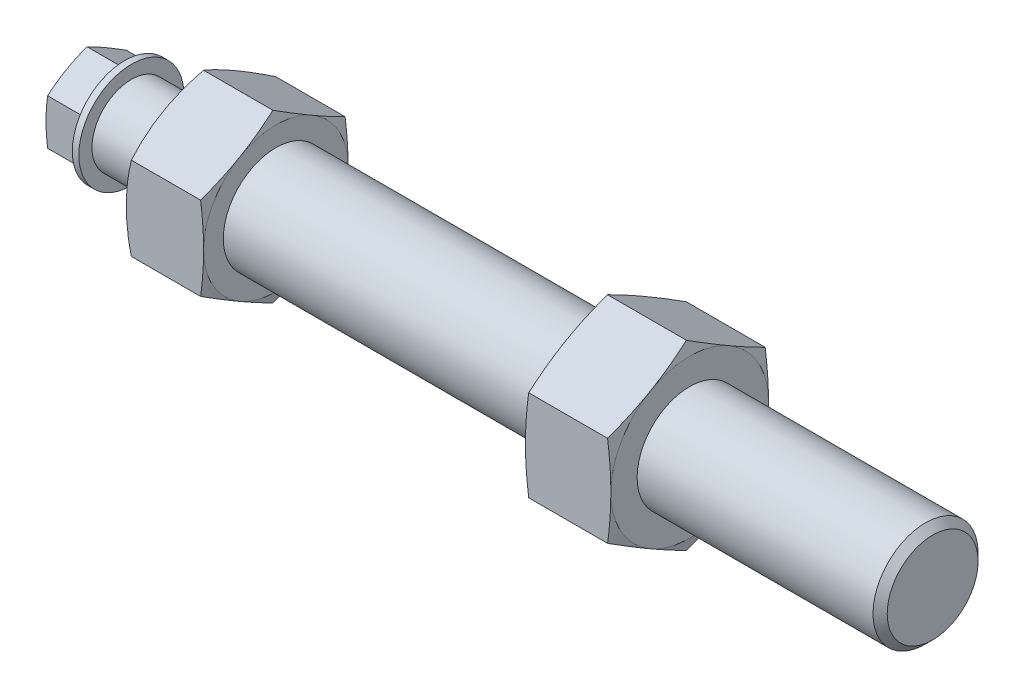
ISO-10303-21;
HEADER;
FILE_DESCRIPTION(('STEP AP214'),'2;1');
FILE_NAME('part.step','',(''),(''),'','','');
FILE_SCHEMA(('AUTOMOTIVE_DESIGN { 1 0 10303 214 1 1 1 1 }'));
ENDSEC;
DATA;
#1=APPLICATION_CONTEXT('core data for automotive mechanical design processes');
#2=APPLICATION_PROTOCOL_DEFINITION('international standard','automotive_design',2000,#1);
#3=PRODUCT_CONTEXT('',#1,'mechanical');
#4=PRODUCT('Part','Part','',(#3));
#5=PRODUCT_RELATED_PRODUCT_CATEGORY('part','',(#4));
#6=PRODUCT_DEFINITION_FORMATION('','',#4);
#7=PRODUCT_DEFINITION_CONTEXT('part definition',#1,'design');
#8=PRODUCT_DEFINITION('design','',#6,#7);
#9=PRODUCT_DEFINITION_SHAPE('','',#8);
#10=(LENGTH_UNIT() NAMED_UNIT(*) SI_UNIT(.MILLI.,.METRE.));
#11=(NAMED_UNIT(*) PLANE_ANGLE_UNIT() SI_UNIT($,.RADIAN.));
#12=(NAMED_UNIT(*) SI_UNIT($,.STERADIAN.) SOLID_ANGLE_UNIT());
#13=UNCERTAINTY_MEASURE_WITH_UNIT(LENGTH_MEASURE(1.E-05),#10,'distance_accuracy_value','');
#14=(GEOMETRIC_REPRESENTATION_CONTEXT(3) GLOBAL_UNCERTAINTY_ASSIGNED_CONTEXT((#13)) GLOBAL_UNIT_ASSIGNED_CONTEXT((#10,
#11,#12)) REPRESENTATION_CONTEXT('',''));
#15=CARTESIAN_POINT('',(0.,0.,0.));
#16=DIRECTION('',(0.,0.,1.));
#17=DIRECTION('',(1.,0.,0.));
#18=AXIS2_PLACEMENT_3D('',#15,#16,#17);
#19=CARTESIAN_POINT('',(-29.,3.,0.));
#20=DIRECTION('',(-1.,0.,0.));
#21=DIRECTION('',(0.,0.,1.));
#22=AXIS2_PLACEMENT_3D('',#19,#20,#21);
#23=PLANE('',#22);
#24=CARTESIAN_POINT('',(-28.9999999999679,0.,0.));
#25=DIRECTION('',(1.,0.,0.));
#26=DIRECTION('',(0.,0.,-1.));
#27=AXIS2_PLACEMENT_3D('',#24,#25,#26);
#28=CIRCLE('',#27,6.00000000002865);
#29=CARTESIAN_POINT('',(-28.9999999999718,0.,6.00000000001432));
#30=VERTEX_POINT('',#29);
#31=CARTESIAN_POINT('',(-28.9999999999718,-5.19615242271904,3.00000000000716));
#32=VERTEX_POINT('',#31);
#33=EDGE_CURVE('E1353',#30,#32,#28,.T.);
#34=ORIENTED_EDGE('',*,*,#33,.F.);
#35=CARTESIAN_POINT('',(-28.9999999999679,0.,0.));
#36=DIRECTION('',(1.,0.,0.));
#37=DIRECTION('',(0.,0.,-1.));
#38=AXIS2_PLACEMENT_3D('',#35,#36,#37);
#39=CIRCLE('',#38,6.00000000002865);
#40=CARTESIAN_POINT('',(-28.9999999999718,5.19615242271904,3.00000000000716));
#41=VERTEX_POINT('',#40);
#42=EDGE_CURVE('E515',#41,#30,#39,.T.);
#43=ORIENTED_EDGE('',*,*,#42,.F.);
#44=CARTESIAN_POINT('',(-28.9999999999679,0.,0.));
#45=DIRECTION('',(1.,0.,0.));
#46=DIRECTION('',(0.,0.,-1.));
#47=AXIS2_PLACEMENT_3D('',#44,#45,#46);
#48=CIRCLE('',#47,6.00000000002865);
#49=CARTESIAN_POINT('',(-28.9999999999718,5.19615242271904,-3.00000000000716));
#50=VERTEX_POINT('',#49);
#51=EDGE_CURVE('E1361',#50,#41,#48,.T.);
#52=ORIENTED_EDGE('',*,*,#51,.F.);
#53=CARTESIAN_POINT('',(-28.9999999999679,0.,0.));
#54=DIRECTION('',(1.,0.,0.));
#55=DIRECTION('',(0.,0.,-1.));
#56=AXIS2_PLACEMENT_3D('',#53,#54,#55);
#57=CIRCLE('',#56,6.00000000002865);
#58=CARTESIAN_POINT('',(-28.9999999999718,0.,-6.00000000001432));
#59=VERTEX_POINT('',#58);
#60=EDGE_CURVE('E1366',#59,#50,#57,.T.);
#61=ORIENTED_EDGE('',*,*,#60,.F.);
#62=CARTESIAN_POINT('',(-28.9999999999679,0.,0.));
#63=DIRECTION('',(1.,0.,0.));
#64=DIRECTION('',(0.,0.,-1.));
#65=AXIS2_PLACEMENT_3D('',#62,#63,#64);
#66=CIRCLE('',#65,6.00000000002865);
#67=CARTESIAN_POINT('',(-28.9999999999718,-5.19615242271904,-3.00000000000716));
#68=VERTEX_POINT('',#67);
#69=EDGE_CURVE('E19',#68,#59,#66,.T.);
#70=ORIENTED_EDGE('',*,*,#69,.F.);
#71=CARTESIAN_POINT('',(-28.9999999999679,0.,0.));
#72=DIRECTION('',(1.,0.,0.));
#73=DIRECTION('',(0.,0.,-1.));
#74=AXIS2_PLACEMENT_3D('',#71,#72,#73);
#75=CIRCLE('',#74,6.00000000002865);
#76=EDGE_CURVE('E438',#32,#68,#75,.T.);
#77=ORIENTED_EDGE('',*,*,#76,.F.);
#78=EDGE_LOOP('',(#34,#43,#52,#61,#70,#77));
#79=FACE_BOUND('',#78,.T.);
#80=ADVANCED_FACE('F15',(#79),#23,.T.);
#81=CARTESIAN_POINT('',(-28.7497964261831,0.,0.));
#82=DIRECTION('',(1.,0.,0.));
#83=DIRECTION('',(0.,0.,-1.));
#84=AXIS2_PLACEMENT_3D('',#81,#82,#83);
#85=CONICAL_SURFACE('',#84,6.93377244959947,1.30899693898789);
#86=CARTESIAN_POINT('',(-28.7512886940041,-3.46410161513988,-5.99999999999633));
#87=CARTESIAN_POINT('',(-28.7897757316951,-3.60768878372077,-5.75129972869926));
#88=CARTESIAN_POINT('',(-28.8247238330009,-3.75153368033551,-5.50215305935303));
#89=CARTESIAN_POINT('',(-28.8860972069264,-4.03950834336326,-5.00336631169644));
#90=CARTESIAN_POINT('',(-28.9125321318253,-4.18363759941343,-4.75372711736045));
#91=CARTESIAN_POINT('',(-28.9555332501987,-4.47231148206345,-4.25372928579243));
#92=CARTESIAN_POINT('',(-28.9720971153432,-4.6168561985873,-4.00337049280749));
#93=CARTESIAN_POINT('',(-28.9887785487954,-4.83390649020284,-3.62742835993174));
#94=CARTESIAN_POINT('',(-28.9929783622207,-4.90633773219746,-3.50197376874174));
#95=CARTESIAN_POINT('',(-28.9985924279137,-5.0512294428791,-3.25101396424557));
#96=CARTESIAN_POINT('',(-29.0000065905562,-5.12368991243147,-3.12550874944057));
#97=CARTESIAN_POINT('',(-28.9999999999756,-5.19615242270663,-3.));
#98=B_SPLINE_CURVE_WITH_KNOTS('',3,(#86,#87,#88,#89,#90,#91,#92,#93,#94,#95,#96,#97),
.UNSPECIFIED.,.F.,.F.,(4,2,2,2,2,4),(0.,0.869263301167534,1.73753752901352,2.60601647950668,
3.04076292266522,3.47552335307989),.UNSPECIFIED.);
#99=CARTESIAN_POINT('',(-28.7512886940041,-3.4641016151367,-5.99999999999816));
#100=VERTEX_POINT('',#99);
#101=EDGE_CURVE('E1374',#100,#68,#98,.T.);
#102=ORIENTED_EDGE('',*,*,#101,.T.);
#103=ORIENTED_EDGE('',*,*,#69,.T.);
#104=CARTESIAN_POINT('',(-28.9999999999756,0.,-6.));
#105=CARTESIAN_POINT('',(-29.0000065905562,-0.144925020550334,-6.));
#106=CARTESIAN_POINT('',(-28.9985924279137,-0.289845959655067,-6.));
#107=CARTESIAN_POINT('',(-28.9929783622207,-0.579629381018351,-6.));
#108=CARTESIAN_POINT('',(-28.9887785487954,-0.724491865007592,-6.));
#109=CARTESIAN_POINT('',(-28.9720971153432,-1.15859244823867,-6.));
#110=CARTESIAN_POINT('',(-28.9555332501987,-1.44768188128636,-6.));
#111=CARTESIAN_POINT('',(-28.9125321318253,-2.02502964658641,-6.));
#112=CARTESIAN_POINT('',(-28.8860972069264,-2.31328815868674,-6.));
#113=CARTESIAN_POINT('',(-28.8247238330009,-2.88923748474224,-6.));
#114=CARTESIAN_POINT('',(-28.7897757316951,-3.17692727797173,-6.));
#115=CARTESIAN_POINT('',(-28.7512886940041,-3.46410161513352,-6.));
#116=B_SPLINE_CURVE_WITH_KNOTS('',3,(#104,#105,#106,#107,#108,#109,#110,#111,#112,#113,#114,
#115),.UNSPECIFIED.,.F.,.F.,(4,2,2,2,2,4),(0.,0.434760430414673,0.86950687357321,
1.73798582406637,2.60626005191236,3.47552335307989),.UNSPECIFIED.);
#117=EDGE_CURVE('E468',#59,#100,#116,.T.);
#118=ORIENTED_EDGE('',*,*,#117,.T.);
#119=EDGE_LOOP('',(#102,#103,#118));
#120=FACE_BOUND('',#119,.T.);
#121=ADVANCED_FACE('F964',(#120),#85,.T.);
#122=CARTESIAN_POINT('',(-28.7497964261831,0.,0.));
#123=DIRECTION('',(1.,0.,0.));
#124=DIRECTION('',(0.,0.,-1.));
#125=AXIS2_PLACEMENT_3D('',#122,#123,#124);
#126=CONICAL_SURFACE('',#125,6.93377244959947,1.30899693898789);
#127=CARTESIAN_POINT('',(-28.7512886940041,3.46410161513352,-6.));
#128=CARTESIAN_POINT('',(-28.7897757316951,3.17692727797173,-6.));
#129=CARTESIAN_POINT('',(-28.8247238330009,2.88923748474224,-6.));
#130=CARTESIAN_POINT('',(-28.8860972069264,2.31328815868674,-6.));
#131=CARTESIAN_POINT('',(-28.9125321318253,2.0250296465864,-6.));
#132=CARTESIAN_POINT('',(-28.9555332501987,1.44768188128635,-6.));
#133=CARTESIAN_POINT('',(-28.9720971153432,1.15859244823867,-6.));
#134=CARTESIAN_POINT('',(-28.9887785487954,0.724491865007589,-6.));
#135=CARTESIAN_POINT('',(-28.9929783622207,0.579629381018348,-6.));
#136=CARTESIAN_POINT('',(-28.9985924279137,0.289845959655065,-6.));
#137=CARTESIAN_POINT('',(-29.0000065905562,0.144925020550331,-6.));
#138=CARTESIAN_POINT('',(-28.9999999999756,0.,-6.));
#139=B_SPLINE_CURVE_WITH_KNOTS('',3,(#127,#128,#129,#130,#131,#132,#133,#134,#135,#136,#137,
#138),.UNSPECIFIED.,.F.,.F.,(4,2,2,2,2,4),(0.,0.869263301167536,1.73753752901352,
2.60601647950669,3.04076292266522,3.4755233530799),.UNSPECIFIED.);
#140=CARTESIAN_POINT('',(-28.7512886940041,3.4641016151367,-5.99999999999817));
#141=VERTEX_POINT('',#140);
#142=EDGE_CURVE('E467',#141,#59,#139,.T.);
#143=ORIENTED_EDGE('',*,*,#142,.T.);
#144=ORIENTED_EDGE('',*,*,#60,.T.);
#145=CARTESIAN_POINT('',(-28.9999999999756,5.19615242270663,-3.));
#146=CARTESIAN_POINT('',(-29.0000065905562,5.12368991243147,-3.12550874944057));
#147=CARTESIAN_POINT('',(-28.9985924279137,5.0512294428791,-3.25101396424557));
#148=CARTESIAN_POINT('',(-28.9929783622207,4.90633773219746,-3.50197376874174));
#149=CARTESIAN_POINT('',(-28.9887785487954,4.83390649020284,-3.62742835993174));
#150=CARTESIAN_POINT('',(-28.9720971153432,4.6168561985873,-4.00337049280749));
#151=CARTESIAN_POINT('',(-28.9555332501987,4.47231148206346,-4.25372928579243));
#152=CARTESIAN_POINT('',(-28.9125321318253,4.18363759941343,-4.75372711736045));
#153=CARTESIAN_POINT('',(-28.8860972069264,4.03950834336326,-5.00336631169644));
#154=CARTESIAN_POINT('',(-28.8247238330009,3.75153368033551,-5.50215305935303));
#155=CARTESIAN_POINT('',(-28.7897757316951,3.60768878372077,-5.75129972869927));
#156=CARTESIAN_POINT('',(-28.7512886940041,3.46410161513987,-5.99999999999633));
#157=B_SPLINE_CURVE_WITH_KNOTS('',3,(#145,#146,#147,#148,#149,#150,#151,#152,#153,#154,#155,
#156),.UNSPECIFIED.,.F.,.F.,(4,2,2,2,2,4),(0.,0.434760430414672,0.869506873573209,
1.73798582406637,2.60626005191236,3.47552335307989),.UNSPECIFIED.);
#158=EDGE_CURVE('E475',#50,#141,#157,.T.);
#159=ORIENTED_EDGE('',*,*,#158,.T.);
#160=EDGE_LOOP('',(#143,#144,#159));
#161=FACE_BOUND('',#160,.T.);
#162=ADVANCED_FACE('F958',(#161),#126,.T.);
#163=CARTESIAN_POINT('',(-28.7497964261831,0.,0.));
#164=DIRECTION('',(1.,0.,0.));
#165=DIRECTION('',(0.,0.,-1.));
#166=AXIS2_PLACEMENT_3D('',#163,#164,#165);
#167=CONICAL_SURFACE('',#166,6.93377244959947,1.30899693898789);
#168=ORIENTED_EDGE('',*,*,#51,.T.);
#169=CARTESIAN_POINT('',(-28.9999999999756,5.19615242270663,3.));
#170=CARTESIAN_POINT('',(-29.0000065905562,5.2686149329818,2.87449125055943));
#171=CARTESIAN_POINT('',(-28.9985924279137,5.34107540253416,2.74898603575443));
#172=CARTESIAN_POINT('',(-28.9929783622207,5.48596711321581,2.49802623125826));
#173=CARTESIAN_POINT('',(-28.9887785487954,5.55839835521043,2.37257164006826));
#174=CARTESIAN_POINT('',(-28.9720971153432,5.77544864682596,1.99662950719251));
#175=CARTESIAN_POINT('',(-28.9555332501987,5.91999336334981,1.74627071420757));
#176=CARTESIAN_POINT('',(-28.9125321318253,6.20866724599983,1.24627288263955));
#177=CARTESIAN_POINT('',(-28.8860972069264,6.35279650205,0.996633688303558));
#178=CARTESIAN_POINT('',(-28.8247238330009,6.64077116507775,0.497846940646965));
#179=CARTESIAN_POINT('',(-28.7897757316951,6.7846160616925,0.248700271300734));
#180=CARTESIAN_POINT('',(-28.7512886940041,6.92820323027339,3.67158282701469E-12));
#181=B_SPLINE_CURVE_WITH_KNOTS('',3,(#169,#170,#171,#172,#173,#174,#175,#176,#177,#178,#179,
#180),.UNSPECIFIED.,.F.,.F.,(4,2,2,2,2,4),(0.,0.434760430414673,0.869506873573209,
1.73798582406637,2.60626005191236,3.47552335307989),.UNSPECIFIED.);
#182=CARTESIAN_POINT('',(-28.7512886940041,6.92820323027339,0.));
#183=VERTEX_POINT('',#182);
#184=EDGE_CURVE('E488',#41,#183,#181,.T.);
#185=ORIENTED_EDGE('',*,*,#184,.T.);
#186=CARTESIAN_POINT('',(-28.7512886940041,6.92820323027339,-3.6712566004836E-12));
#187=CARTESIAN_POINT('',(-28.7897757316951,6.7846160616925,-0.248700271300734));
#188=CARTESIAN_POINT('',(-28.8247238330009,6.64077116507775,-0.497846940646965));
#189=CARTESIAN_POINT('',(-28.8860972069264,6.35279650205,-0.996633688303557));
#190=CARTESIAN_POINT('',(-28.9125321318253,6.20866724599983,-1.24627288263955));
#191=CARTESIAN_POINT('',(-28.9555332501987,5.91999336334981,-1.74627071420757));
#192=CARTESIAN_POINT('',(-28.9720971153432,5.77544864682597,-1.99662950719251));
#193=CARTESIAN_POINT('',(-28.9887785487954,5.55839835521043,-2.37257164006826));
#194=CARTESIAN_POINT('',(-28.9929783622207,5.48596711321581,-2.49802623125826));
#195=CARTESIAN_POINT('',(-28.9985924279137,5.34107540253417,-2.74898603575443));
#196=CARTESIAN_POINT('',(-29.0000065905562,5.2686149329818,-2.87449125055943));
#197=CARTESIAN_POINT('',(-28.9999999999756,5.19615242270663,-3.));
#198=B_SPLINE_CURVE_WITH_KNOTS('',3,(#186,#187,#188,#189,#190,#191,#192,#193,#194,#195,#196,
#197),.UNSPECIFIED.,.F.,.F.,(4,2,2,2,2,4),(0.,0.869263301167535,1.73753752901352,
2.60601647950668,3.04076292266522,3.47552335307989),.UNSPECIFIED.);
#199=EDGE_CURVE('E474',#183,#50,#198,.T.);
#200=ORIENTED_EDGE('',*,*,#199,.T.);
#201=EDGE_LOOP('',(#168,#185,#200));
#202=FACE_BOUND('',#201,.T.);
#203=ADVANCED_FACE('F955',(#202),#167,.T.);
#204=CARTESIAN_POINT('',(-28.7497964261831,0.,0.));
#205=DIRECTION('',(1.,0.,0.));
#206=DIRECTION('',(0.,0.,-1.));
#207=AXIS2_PLACEMENT_3D('',#204,#205,#206);
#208=CONICAL_SURFACE('',#207,6.93377244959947,1.30899693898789);
#209=ORIENTED_EDGE('',*,*,#42,.T.);
#210=CARTESIAN_POINT('',(-28.9999999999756,0.,6.));
#211=CARTESIAN_POINT('',(-29.0000065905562,0.144925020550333,6.));
#212=CARTESIAN_POINT('',(-28.9985924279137,0.289845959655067,6.));
#213=CARTESIAN_POINT('',(-28.9929783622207,0.57962938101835,6.));
#214=CARTESIAN_POINT('',(-28.9887785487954,0.724491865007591,6.));
#215=CARTESIAN_POINT('',(-28.9720971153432,1.15859244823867,6.));
#216=CARTESIAN_POINT('',(-28.9555332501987,1.44768188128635,6.));
#217=CARTESIAN_POINT('',(-28.9125321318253,2.0250296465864,6.));
#218=CARTESIAN_POINT('',(-28.8860972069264,2.31328815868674,6.));
#219=CARTESIAN_POINT('',(-28.8247238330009,2.88923748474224,6.));
#220=CARTESIAN_POINT('',(-28.7897757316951,3.17692727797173,6.));
#221=CARTESIAN_POINT('',(-28.7512886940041,3.46410161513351,6.));
#222=B_SPLINE_CURVE_WITH_KNOTS('',3,(#210,#211,#212,#213,#214,#215,#216,#217,#218,#219,#220,
#221),.UNSPECIFIED.,.F.,.F.,(4,2,2,2,2,4),(0.,0.434760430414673,0.869506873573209,
1.73798582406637,2.60626005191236,3.47552335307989),.UNSPECIFIED.);
#223=CARTESIAN_POINT('',(-28.7512886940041,3.46410161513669,5.99999999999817));
#224=VERTEX_POINT('',#223);
#225=EDGE_CURVE('E495',#30,#224,#222,.T.);
#226=ORIENTED_EDGE('',*,*,#225,.T.);
#227=CARTESIAN_POINT('',(-28.7512886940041,3.46410161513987,5.99999999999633));
#228=CARTESIAN_POINT('',(-28.7897757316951,3.60768878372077,5.75129972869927));
#229=CARTESIAN_POINT('',(-28.8247238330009,3.75153368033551,5.50215305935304));
#230=CARTESIAN_POINT('',(-28.8860972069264,4.03950834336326,5.00336631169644));
#231=CARTESIAN_POINT('',(-28.9125321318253,4.18363759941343,4.75372711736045));
#232=CARTESIAN_POINT('',(-28.9555332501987,4.47231148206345,4.25372928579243));
#233=CARTESIAN_POINT('',(-28.9720971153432,4.6168561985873,4.00337049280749));
#234=CARTESIAN_POINT('',(-28.9887785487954,4.83390649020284,3.62742835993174));
#235=CARTESIAN_POINT('',(-28.9929783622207,4.90633773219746,3.50197376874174));
#236=CARTESIAN_POINT('',(-28.9985924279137,5.0512294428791,3.25101396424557));
#237=CARTESIAN_POINT('',(-29.0000065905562,5.12368991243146,3.12550874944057));
#238=CARTESIAN_POINT('',(-28.9999999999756,5.19615242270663,3.));
#239=B_SPLINE_CURVE_WITH_KNOTS('',3,(#227,#228,#229,#230,#231,#232,#233,#234,#235,#236,#237,
#238),.UNSPECIFIED.,.F.,.F.,(4,2,2,2,2,4),(0.,0.869263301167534,1.73753752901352,
2.60601647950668,3.04076292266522,3.47552335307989),.UNSPECIFIED.);
#240=EDGE_CURVE('E481',#224,#41,#239,.T.);
#241=ORIENTED_EDGE('',*,*,#240,.T.);
#242=EDGE_LOOP('',(#209,#226,#241));
#243=FACE_BOUND('',#242,.T.);
#244=ADVANCED_FACE('F455',(#243),#208,.T.);
#245=CARTESIAN_POINT('',(-28.7508072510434,0.,0.));
#246=DIRECTION('',(1.,0.,0.));
#247=DIRECTION('',(0.,0.,-1.));
#248=AXIS2_PLACEMENT_3D('',#245,#246,#247);
#249=CONICAL_SURFACE('',#248,6.92999999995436,1.3089969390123);
#250=CARTESIAN_POINT('',(-28.752833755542,-6.92242975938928,0.00999994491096));
#251=CARTESIAN_POINT('',(-28.7910977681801,-6.77931768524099,0.257877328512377));
#252=CARTESIAN_POINT('',(-28.8258364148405,-6.63594964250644,0.50619806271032));
#253=CARTESIAN_POINT('',(-28.886833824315,-6.34893081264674,1.00332925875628));
#254=CARTESIAN_POINT('',(-28.9131021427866,-6.20528052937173,1.25213884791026));
#255=CARTESIAN_POINT('',(-28.9558276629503,-5.9175685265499,1.75047065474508));
#256=CARTESIAN_POINT('',(-28.9722825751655,-5.77350671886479,1.9999930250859));
#257=CARTESIAN_POINT('',(-28.9888535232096,-5.55718296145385,2.37467676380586));
#258=CARTESIAN_POINT('',(-28.993025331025,-5.48499461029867,2.49971065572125));
#259=CARTESIAN_POINT('',(-28.9986018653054,-5.34058898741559,2.74982853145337));
#260=CARTESIAN_POINT('',(-29.0000065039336,-5.26837171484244,2.87491251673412));
#261=CARTESIAN_POINT('',(-28.9999999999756,-5.19615242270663,3.));
#262=B_SPLINE_CURVE_WITH_KNOTS('',3,(#250,#251,#252,#253,#254,#255,#256,#257,#258,#259,#260,
#261),.UNSPECIFIED.,.F.,.F.,(4,2,2,2,2,4),(0.,0.866348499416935,1.73171619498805,
2.59728570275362,3.030573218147,3.4638744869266),.UNSPECIFIED.);
#263=CARTESIAN_POINT('',(-28.7528336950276,-6.92242998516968,0.00999997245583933));
#264=VERTEX_POINT('',#263);
#265=EDGE_CURVE('E494',#264,#32,#262,.T.);
#266=ORIENTED_EDGE('',*,*,#265,.T.);
#267=ORIENTED_EDGE('',*,*,#76,.T.);
#268=CARTESIAN_POINT('',(-28.9999999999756,-5.19615242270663,-3.));
#269=CARTESIAN_POINT('',(-29.0000065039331,-5.26837171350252,-2.87491251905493));
#270=CARTESIAN_POINT('',(-28.9986018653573,-5.34058898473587,-2.74982853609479));
#271=CARTESIAN_POINT('',(-28.9930253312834,-5.48499460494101,-2.49971066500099));
#272=CARTESIAN_POINT('',(-28.9888535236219,-5.55718295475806,-2.3746767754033));
#273=CARTESIAN_POINT('',(-28.9722825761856,-5.77350670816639,-1.99999304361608));
#274=CARTESIAN_POINT('',(-28.9558276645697,-5.91756851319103,-1.75047067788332));
#275=CARTESIAN_POINT('',(-28.9131021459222,-6.20528051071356,-1.25213888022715));
#276=CARTESIAN_POINT('',(-28.8868338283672,-6.34893079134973,-1.00332929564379));
#277=CARTESIAN_POINT('',(-28.8258364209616,-6.63594961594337,-0.5061981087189));
#278=CARTESIAN_POINT('',(-28.7910977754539,-6.77931765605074,-0.257877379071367));
#279=CARTESIAN_POINT('',(-28.7528337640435,-6.92242972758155,-0.0100000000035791));
#280=B_SPLINE_CURVE_WITH_KNOTS('',3,(#268,#269,#270,#271,#272,#273,#274,#275,#276,#277,#278,
#279),.UNSPECIFIED.,.F.,.F.,(4,2,2,2,2,4),(0.,0.433301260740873,0.86658876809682,
1.73215825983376,2.5975259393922,3.463874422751),.UNSPECIFIED.);
#281=CARTESIAN_POINT('',(-28.7528337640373,-6.92242972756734,-0.0100000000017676));
#282=VERTEX_POINT('',#281);
#283=EDGE_CURVE('E1355',#68,#282,#280,.T.);
#284=ORIENTED_EDGE('',*,*,#283,.T.);
#285=CARTESIAN_POINT('',(-28.752833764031,-6.92242972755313,-0.00999999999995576));
#286=CARTESIAN_POINT('',(-28.7527493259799,-6.92274485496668,-0.0100000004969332));
#287=CARTESIAN_POINT('',(-28.752664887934,-6.92305998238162,-0.0100000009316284));
#288=CARTESIAN_POINT('',(-28.7524960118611,-6.92369023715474,-0.0100000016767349));
#289=CARTESIAN_POINT('',(-28.7524115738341,-6.92400536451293,-0.0100000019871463));
#290=CARTESIAN_POINT('',(-28.7522426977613,-6.92463561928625,-0.0100000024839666));
#291=CARTESIAN_POINT('',(-28.7521582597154,-6.92495074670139,-0.0100000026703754));
#292=CARTESIAN_POINT('',(-28.7519893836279,-6.92558100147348,-0.0100000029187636));
#293=CARTESIAN_POINT('',(-28.7519049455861,-6.92589612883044,-0.010000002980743));
#294=CARTESIAN_POINT('',(-28.7517360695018,-6.92652638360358,-0.0100000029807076));
#295=CARTESIAN_POINT('',(-28.7516516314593,-6.92684151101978,-0.0100000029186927));
#296=CARTESIAN_POINT('',(-28.7514827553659,-6.9274717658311,-0.0100000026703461));
#297=CARTESIAN_POINT('',(-28.7513983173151,-6.92778689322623,-0.0100000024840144));
#298=CARTESIAN_POINT('',(-28.7512294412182,-6.9284171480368,-0.0100000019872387));
#299=CARTESIAN_POINT('',(-28.7511450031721,-6.92873227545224,-0.0100000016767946));
#300=CARTESIAN_POINT('',(-28.7509761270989,-6.92936253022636,-0.0100000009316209));
#301=CARTESIAN_POINT('',(-28.7508916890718,-6.92967765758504,-0.0100000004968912));
#302=CARTESIAN_POINT('',(-28.7508072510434,-6.92999278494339,-0.0099999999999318));
#303=B_SPLINE_CURVE_WITH_KNOTS('',3,(#285,#286,#287,#288,#289,#290,#291,#292,#293,#294,#295,
#296,#297,#298,#299,#300,#301,#302),.UNSPECIFIED.,.F.,.F.,(4,2,2,2,2,2,2,2,4),(0.,
0.000978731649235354,0.0019574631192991,0.00293619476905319,0.00391492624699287,
0.00489365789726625,0.00587238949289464,0.00685112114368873,0.00782985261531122),.UNSPECIFIED.);
#304=CARTESIAN_POINT('',(-28.7508072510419,-6.9299927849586,-0.00999999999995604));
#305=VERTEX_POINT('',#304);
#306=EDGE_CURVE('E444',#282,#305,#303,.T.);
#307=ORIENTED_EDGE('',*,*,#306,.T.);
#308=CARTESIAN_POINT('',(-28.7508072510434,0.,0.));
#309=DIRECTION('',(1.,0.,0.));
#310=DIRECTION('',(0.,1.,0.));
#311=AXIS2_PLACEMENT_3D('',#308,#309,#310);
#312=CIRCLE('',#311,6.92999999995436);
#313=CARTESIAN_POINT('',(-28.7508072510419,-6.9299927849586,0.00999999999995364));
#314=VERTEX_POINT('',#313);
#315=EDGE_CURVE('E439',#305,#314,#312,.F.);
#316=ORIENTED_EDGE('',*,*,#315,.T.);
#317=CARTESIAN_POINT('',(-28.7508072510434,-6.92999278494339,0.00999999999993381));
#318=CARTESIAN_POINT('',(-28.7508916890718,-6.92967765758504,0.0100000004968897));
#319=CARTESIAN_POINT('',(-28.7509761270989,-6.92936253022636,0.0100000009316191));
#320=CARTESIAN_POINT('',(-28.7511450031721,-6.92873227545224,0.0100000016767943));
#321=CARTESIAN_POINT('',(-28.7512294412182,-6.9284171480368,0.0100000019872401));
#322=CARTESIAN_POINT('',(-28.7513983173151,-6.92778689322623,0.010000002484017));
#323=CARTESIAN_POINT('',(-28.7514827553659,-6.9274717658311,0.0100000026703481));
#324=CARTESIAN_POINT('',(-28.7516516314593,-6.92684151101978,0.0100000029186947));
#325=CARTESIAN_POINT('',(-28.7517360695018,-6.92652638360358,0.0100000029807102));
#326=CARTESIAN_POINT('',(-28.7519049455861,-6.92589612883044,0.0100000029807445));
#327=CARTESIAN_POINT('',(-28.7519893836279,-6.92558100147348,0.0100000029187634));
#328=CARTESIAN_POINT('',(-28.7521582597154,-6.92495074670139,0.0100000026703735));
#329=CARTESIAN_POINT('',(-28.7522426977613,-6.92463561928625,0.0100000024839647));
#330=CARTESIAN_POINT('',(-28.7524115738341,-6.92400536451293,0.0100000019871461));
#331=CARTESIAN_POINT('',(-28.7524960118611,-6.92369023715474,0.0100000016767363));
#332=CARTESIAN_POINT('',(-28.752664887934,-6.92305998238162,0.010000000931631));
#333=CARTESIAN_POINT('',(-28.7527493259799,-6.92274485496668,0.0100000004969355));
#334=CARTESIAN_POINT('',(-28.752833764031,-6.92242972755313,0.0099999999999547));
#335=B_SPLINE_CURVE_WITH_KNOTS('',3,(#317,#318,#319,#320,#321,#322,#323,#324,#325,#326,#327,
#328,#329,#330,#331,#332,#333,#334),.UNSPECIFIED.,.F.,.F.,(4,2,2,2,2,2,2,2,4),(0.,
0.000978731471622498,0.00195746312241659,0.00293619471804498,0.00391492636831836,
0.00489365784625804,0.00587238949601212,0.00685112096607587,0.00782985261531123),.UNSPECIFIED.);
#336=EDGE_CURVE('E211',#314,#264,#335,.T.);
#337=ORIENTED_EDGE('',*,*,#336,.T.);
#338=EDGE_LOOP('',(#266,#267,#284,#307,#316,#337));
#339=FACE_BOUND('',#338,.T.);
#340=ADVANCED_FACE('F458',(#339),#249,.T.);
#341=CARTESIAN_POINT('',(-28.7497964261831,0.,0.));
#342=DIRECTION('',(1.,0.,0.));
#343=DIRECTION('',(0.,0.,-1.));
#344=AXIS2_PLACEMENT_3D('',#341,#342,#343);
#345=CONICAL_SURFACE('',#344,6.93377244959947,1.30899693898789);
#346=ORIENTED_EDGE('',*,*,#33,.T.);
#347=CARTESIAN_POINT('',(-28.9999999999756,-5.19615242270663,3.));
#348=CARTESIAN_POINT('',(-29.0000065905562,-5.12368991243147,3.12550874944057));
#349=CARTESIAN_POINT('',(-28.9985924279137,-5.0512294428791,3.25101396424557));
#350=CARTESIAN_POINT('',(-28.9929783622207,-4.90633773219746,3.50197376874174));
#351=CARTESIAN_POINT('',(-28.9887785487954,-4.83390649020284,3.62742835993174));
#352=CARTESIAN_POINT('',(-28.9720971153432,-4.6168561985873,4.00337049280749));
#353=CARTESIAN_POINT('',(-28.9555332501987,-4.47231148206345,4.25372928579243));
#354=CARTESIAN_POINT('',(-28.9125321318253,-4.18363759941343,4.75372711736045));
#355=CARTESIAN_POINT('',(-28.8860972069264,-4.03950834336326,5.00336631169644));
#356=CARTESIAN_POINT('',(-28.8247238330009,-3.75153368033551,5.50215305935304));
#357=CARTESIAN_POINT('',(-28.7897757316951,-3.60768878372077,5.75129972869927));
#358=CARTESIAN_POINT('',(-28.7512886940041,-3.46410161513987,5.99999999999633));
#359=B_SPLINE_CURVE_WITH_KNOTS('',3,(#347,#348,#349,#350,#351,#352,#353,#354,#355,#356,#357,
#358),.UNSPECIFIED.,.F.,.F.,(4,2,2,2,2,4),(0.,0.434760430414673,0.86950687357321,
1.73798582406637,2.60626005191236,3.47552335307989),.UNSPECIFIED.);
#360=CARTESIAN_POINT('',(-28.7512886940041,-3.46410161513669,5.99999999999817));
#361=VERTEX_POINT('',#360);
#362=EDGE_CURVE('E434',#32,#361,#359,.T.);
#363=ORIENTED_EDGE('',*,*,#362,.T.);
#364=CARTESIAN_POINT('',(-28.7512886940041,-3.46410161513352,6.));
#365=CARTESIAN_POINT('',(-28.7897757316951,-3.17692727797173,6.));
#366=CARTESIAN_POINT('',(-28.8247238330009,-2.88923748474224,6.));
#367=CARTESIAN_POINT('',(-28.8860972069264,-2.31328815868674,6.));
#368=CARTESIAN_POINT('',(-28.9125321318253,-2.0250296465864,6.));
#369=CARTESIAN_POINT('',(-28.9555332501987,-1.44768188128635,6.));
#370=CARTESIAN_POINT('',(-28.9720971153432,-1.15859244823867,6.));
#371=CARTESIAN_POINT('',(-28.9887785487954,-0.72449186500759,6.));
#372=CARTESIAN_POINT('',(-28.9929783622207,-0.579629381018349,6.));
#373=CARTESIAN_POINT('',(-28.9985924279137,-0.289845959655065,6.));
#374=CARTESIAN_POINT('',(-29.0000065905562,-0.144925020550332,6.));
#375=CARTESIAN_POINT('',(-28.9999999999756,0.,6.));
#376=B_SPLINE_CURVE_WITH_KNOTS('',3,(#364,#365,#366,#367,#368,#369,#370,#371,#372,#373,#374,
#375),.UNSPECIFIED.,.F.,.F.,(4,2,2,2,2,4),(0.,0.869263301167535,1.73753752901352,
2.60601647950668,3.04076292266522,3.47552335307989),.UNSPECIFIED.);
#377=EDGE_CURVE('E487',#361,#30,#376,.T.);
#378=ORIENTED_EDGE('',*,*,#377,.T.);
#379=EDGE_LOOP('',(#346,#363,#378));
#380=FACE_BOUND('',#379,.T.);
#381=ADVANCED_FACE('F904',(#380),#345,.T.);
#382=CARTESIAN_POINT('',(-34.99,-6.92242972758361,-0.0100000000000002));
#383=DIRECTION('',(0.,0.866025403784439,0.5));
#384=DIRECTION('',(0.,-0.5,0.866025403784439));
#385=AXIS2_PLACEMENT_3D('',#382,#383,#384);
#386=PLANE('',#385);
#387=DIRECTION('',(1.,0.,0.));
#388=VECTOR('',#387,1.);
#389=CARTESIAN_POINT('',(-34.99,-3.46410161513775,-6.));
#390=LINE('',#389,#388);
#391=CARTESIAN_POINT('',(-23.01,-3.46410161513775,-6.));
#392=VERTEX_POINT('',#391);
#393=EDGE_CURVE('E464',#100,#392,#390,.T.);
#394=ORIENTED_EDGE('',*,*,#393,.T.);
#395=DIRECTION('',(0.,0.5,-0.866025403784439));
#396=VECTOR('',#395,1.);
#397=CARTESIAN_POINT('',(-23.01,-6.92242972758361,-0.0100000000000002));
#398=LINE('',#397,#396);
#399=CARTESIAN_POINT('',(-23.01,-6.92242972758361,-0.010000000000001));
#400=VERTEX_POINT('',#399);
#401=EDGE_CURVE('E423',#400,#392,#398,.T.);
#402=ORIENTED_EDGE('',*,*,#401,.F.);
#403=DIRECTION('',(1.,0.,0.));
#404=VECTOR('',#403,1.);
#405=CARTESIAN_POINT('',(-34.99,-6.92242972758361,-0.0100000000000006));
#406=LINE('',#405,#404);
#407=EDGE_CURVE('E431',#400,#282,#406,.F.);
#408=ORIENTED_EDGE('',*,*,#407,.T.);
#409=ORIENTED_EDGE('',*,*,#283,.F.);
#410=ORIENTED_EDGE('',*,*,#101,.F.);
#411=EDGE_LOOP('',(#394,#402,#408,#409,#410));
#412=FACE_BOUND('',#411,.T.);
#413=ADVANCED_FACE('F908',(#412),#386,.F.);
#414=CARTESIAN_POINT('',(-34.99,-3.46410161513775,-6.));
#415=DIRECTION('',(0.,0.,1.));
#416=DIRECTION('',(1.,0.,0.));
#417=AXIS2_PLACEMENT_3D('',#414,#415,#416);
#418=PLANE('',#417);
#419=DIRECTION('',(1.,0.,0.));
#420=VECTOR('',#419,1.);
#421=CARTESIAN_POINT('',(-34.99,3.46410161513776,-6.));
#422=LINE('',#421,#420);
#423=CARTESIAN_POINT('',(-23.01,3.46410161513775,-6.));
#424=VERTEX_POINT('',#423);
#425=EDGE_CURVE('E471',#141,#424,#422,.T.);
#426=ORIENTED_EDGE('',*,*,#425,.T.);
#427=DIRECTION('',(0.,1.,0.));
#428=VECTOR('',#427,1.);
#429=CARTESIAN_POINT('',(-23.01,0.,-6.));
#430=LINE('',#429,#428);
#431=EDGE_CURVE('E418',#392,#424,#430,.T.);
#432=ORIENTED_EDGE('',*,*,#431,.F.);
#433=ORIENTED_EDGE('',*,*,#393,.F.);
#434=ORIENTED_EDGE('',*,*,#117,.F.);
#435=ORIENTED_EDGE('',*,*,#142,.F.);
#436=EDGE_LOOP('',(#426,#432,#433,#434,#435));
#437=FACE_BOUND('',#436,.T.);
#438=ADVANCED_FACE('F978',(#437),#418,.F.);
#439=CARTESIAN_POINT('',(-34.99,3.46410161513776,-6.));
#440=DIRECTION('',(0.,-0.866025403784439,0.5));
#441=DIRECTION('',(0.,-0.5,-0.866025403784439));
#442=AXIS2_PLACEMENT_3D('',#439,#440,#441);
#443=PLANE('',#442);
#444=DIRECTION('',(1.,0.,0.));
#445=VECTOR('',#444,1.);
#446=CARTESIAN_POINT('',(-34.99,6.92820323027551,0.));
#447=LINE('',#446,#445);
#448=CARTESIAN_POINT('',(-23.01,6.92820323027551,0.));
#449=VERTEX_POINT('',#448);
#450=EDGE_CURVE('E478',#183,#449,#447,.T.);
#451=ORIENTED_EDGE('',*,*,#450,.T.);
#452=DIRECTION('',(0.,0.5,0.866025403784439));
#453=VECTOR('',#452,1.);
#454=CARTESIAN_POINT('',(-23.01,3.46410161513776,-6.));
#455=LINE('',#454,#453);
#456=EDGE_CURVE('E413',#424,#449,#455,.T.);
#457=ORIENTED_EDGE('',*,*,#456,.F.);
#458=ORIENTED_EDGE('',*,*,#425,.F.);
#459=ORIENTED_EDGE('',*,*,#158,.F.);
#460=ORIENTED_EDGE('',*,*,#199,.F.);
#461=EDGE_LOOP('',(#451,#457,#458,#459,#460));
#462=FACE_BOUND('',#461,.T.);
#463=ADVANCED_FACE('F936',(#462),#443,.F.);
#464=CARTESIAN_POINT('',(-34.99,6.92820323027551,0.));
#465=DIRECTION('',(0.,-0.866025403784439,-0.5));
#466=DIRECTION('',(0.,0.5,-0.866025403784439));
#467=AXIS2_PLACEMENT_3D('',#464,#465,#466);
#468=PLANE('',#467);
#469=ORIENTED_EDGE('',*,*,#240,.F.);
#470=DIRECTION('',(-1.,0.,0.));
#471=VECTOR('',#470,1.);
#472=CARTESIAN_POINT('',(-34.99,3.46410161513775,6.));
#473=LINE('',#472,#471);
#474=CARTESIAN_POINT('',(-23.01,3.46410161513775,6.));
#475=VERTEX_POINT('',#474);
#476=EDGE_CURVE('E484',#224,#475,#473,.F.);
#477=ORIENTED_EDGE('',*,*,#476,.T.);
#478=DIRECTION('',(0.,-0.5,0.866025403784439));
#479=VECTOR('',#478,1.);
#480=CARTESIAN_POINT('',(-23.01,6.92820323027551,0.));
#481=LINE('',#480,#479);
#482=EDGE_CURVE('E408',#449,#475,#481,.T.);
#483=ORIENTED_EDGE('',*,*,#482,.F.);
#484=ORIENTED_EDGE('',*,*,#450,.F.);
#485=ORIENTED_EDGE('',*,*,#184,.F.);
#486=EDGE_LOOP('',(#469,#477,#483,#484,#485));
#487=FACE_BOUND('',#486,.T.);
#488=ADVANCED_FACE('F930',(#487),#468,.F.);
#489=CARTESIAN_POINT('',(-34.99,3.46410161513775,6.));
#490=DIRECTION('',(0.,0.,-1.));
#491=DIRECTION('',(-1.,0.,0.));
#492=AXIS2_PLACEMENT_3D('',#489,#490,#491);
#493=PLANE('',#492);
#494=ORIENTED_EDGE('',*,*,#377,.F.);
#495=DIRECTION('',(1.,0.,0.));
#496=VECTOR('',#495,1.);
#497=CARTESIAN_POINT('',(-34.99,-3.46410161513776,6.));
#498=LINE('',#497,#496);
#499=CARTESIAN_POINT('',(-23.01,-3.46410161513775,6.));
#500=VERTEX_POINT('',#499);
#501=EDGE_CURVE('E491',#361,#500,#498,.T.);
#502=ORIENTED_EDGE('',*,*,#501,.T.);
#503=DIRECTION('',(0.,1.,0.));
#504=VECTOR('',#503,1.);
#505=CARTESIAN_POINT('',(-23.01,0.,6.));
#506=LINE('',#505,#504);
#507=EDGE_CURVE('E399',#475,#500,#506,.F.);
#508=ORIENTED_EDGE('',*,*,#507,.F.);
#509=ORIENTED_EDGE('',*,*,#476,.F.);
#510=ORIENTED_EDGE('',*,*,#225,.F.);
#511=EDGE_LOOP('',(#494,#502,#508,#509,#510));
#512=FACE_BOUND('',#511,.T.);
#513=ADVANCED_FACE('F927',(#512),#493,.F.);
#514=CARTESIAN_POINT('',(-34.99,-3.46410161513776,6.));
#515=DIRECTION('',(0.,0.866025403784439,-0.5));
#516=DIRECTION('',(0.,0.5,0.866025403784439));
#517=AXIS2_PLACEMENT_3D('',#514,#515,#516);
#518=PLANE('',#517);
#519=ORIENTED_EDGE('',*,*,#265,.F.);
#520=DIRECTION('',(1.,0.,0.));
#521=VECTOR('',#520,1.);
#522=CARTESIAN_POINT('',(-34.99,-6.92242972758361,0.00999999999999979));
#523=LINE('',#522,#521);
#524=CARTESIAN_POINT('',(-23.01,-6.92242972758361,0.00999999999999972));
#525=VERTEX_POINT('',#524);
#526=EDGE_CURVE('E389',#264,#525,#523,.T.);
#527=ORIENTED_EDGE('',*,*,#526,.T.);
#528=DIRECTION('',(0.,-0.5,-0.866025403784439));
#529=VECTOR('',#528,1.);
#530=CARTESIAN_POINT('',(-23.01,-3.46410161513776,6.));
#531=LINE('',#530,#529);
#532=EDGE_CURVE('E396',#500,#525,#531,.T.);
#533=ORIENTED_EDGE('',*,*,#532,.F.);
#534=ORIENTED_EDGE('',*,*,#501,.F.);
#535=ORIENTED_EDGE('',*,*,#362,.F.);
#536=EDGE_LOOP('',(#519,#527,#533,#534,#535));
#537=FACE_BOUND('',#536,.T.);
#538=ADVANCED_FACE('F900',(#537),#518,.F.);
#539=CARTESIAN_POINT('',(-34.99,-11.9999958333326,-0.0100000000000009));
#540=DIRECTION('',(0.,0.,1.));
#541=DIRECTION('',(0.,-1.,0.));
#542=AXIS2_PLACEMENT_3D('',#539,#540,#541);
#543=PLANE('',#542);
#544=ORIENTED_EDGE('',*,*,#407,.F.);
#545=DIRECTION('',(0.,1.,0.));
#546=VECTOR('',#545,1.);
#547=CARTESIAN_POINT('',(-23.01,0.,-0.0100000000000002));
#548=LINE('',#547,#546);
#549=CARTESIAN_POINT('',(-23.01,-6.92999278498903,-0.0100000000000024));
#550=VERTEX_POINT('',#549);
#551=EDGE_CURVE('E428',#550,#400,#548,.T.);
#552=ORIENTED_EDGE('',*,*,#551,.F.);
#553=DIRECTION('',(-1.,0.,0.));
#554=VECTOR('',#553,1.);
#555=CARTESIAN_POINT('',(-25.8754036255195,-6.92999278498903,-0.0100000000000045));
#556=LINE('',#555,#554);
#557=EDGE_CURVE('E388',#305,#550,#556,.F.);
#558=ORIENTED_EDGE('',*,*,#557,.F.);
#559=ORIENTED_EDGE('',*,*,#306,.F.);
#560=EDGE_LOOP('',(#544,#552,#558,#559));
#561=FACE_BOUND('',#560,.T.);
#562=ADVANCED_FACE('F507',(#561),#543,.F.);
#563=CARTESIAN_POINT('',(-23.01,0.,0.));
#564=DIRECTION('',(-1.,0.,0.));
#565=DIRECTION('',(0.,0.,1.));
#566=AXIS2_PLACEMENT_3D('',#563,#564,#565);
#567=PLANE('',#566);
#568=DIRECTION('',(0.,1.,0.));
#569=VECTOR('',#568,1.);
#570=CARTESIAN_POINT('',(-23.01,-6.92242972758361,0.00999999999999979));
#571=LINE('',#570,#569);
#572=CARTESIAN_POINT('',(-23.01,-6.92999278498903,0.00999999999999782));
#573=VERTEX_POINT('',#572);
#574=EDGE_CURVE('E386',#525,#573,#571,.F.);
#575=ORIENTED_EDGE('',*,*,#574,.T.);
#576=CARTESIAN_POINT('',(-23.01,0.,0.));
#577=DIRECTION('',(-1.,0.,0.));
#578=DIRECTION('',(0.,0.,1.));
#579=AXIS2_PLACEMENT_3D('',#576,#577,#578);
#580=CIRCLE('',#579,6.93);
#581=EDGE_CURVE('E383',#550,#573,#580,.F.);
#582=ORIENTED_EDGE('',*,*,#581,.F.);
#583=ORIENTED_EDGE('',*,*,#551,.T.);
#584=ORIENTED_EDGE('',*,*,#401,.T.);
#585=ORIENTED_EDGE('',*,*,#431,.T.);
#586=ORIENTED_EDGE('',*,*,#456,.T.);
#587=ORIENTED_EDGE('',*,*,#482,.T.);
#588=ORIENTED_EDGE('',*,*,#507,.T.);
#589=ORIENTED_EDGE('',*,*,#532,.T.);
#590=EDGE_LOOP('',(#575,#582,#583,#584,#585,#586,#587,#588,#589));
#591=FACE_BOUND('',#590,.T.);
#592=ADVANCED_FACE('F500',(#591),#567,.T.);
#593=CARTESIAN_POINT('',(-34.99,-6.92242972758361,0.00999999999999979));
#594=DIRECTION('',(0.,0.,-1.));
#595=DIRECTION('',(0.,1.,0.));
#596=AXIS2_PLACEMENT_3D('',#593,#594,#595);
#597=PLANE('',#596);
#598=DIRECTION('',(-1.,0.,0.));
#599=VECTOR('',#598,1.);
#600=CARTESIAN_POINT('',(-25.8754036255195,-6.92999278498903,0.00999999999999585));
#601=LINE('',#600,#599);
#602=EDGE_CURVE('E380',#573,#314,#601,.T.);
#603=ORIENTED_EDGE('',*,*,#602,.F.);
#604=ORIENTED_EDGE('',*,*,#574,.F.);
#605=ORIENTED_EDGE('',*,*,#526,.F.);
#606=ORIENTED_EDGE('',*,*,#336,.F.);
#607=EDGE_LOOP('',(#603,#604,#605,#606));
#608=FACE_BOUND('',#607,.T.);
#609=ADVANCED_FACE('F1013',(#608),#597,.F.);
#610=CARTESIAN_POINT('',(-25.8754036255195,0.,0.));
#611=DIRECTION('',(-1.,0.,0.));
#612=DIRECTION('',(0.,0.,1.));
#613=AXIS2_PLACEMENT_3D('',#610,#611,#612);
#614=CYLINDRICAL_SURFACE('',#613,6.93);
#615=ORIENTED_EDGE('',*,*,#557,.T.);
#616=ORIENTED_EDGE('',*,*,#581,.T.);
#617=ORIENTED_EDGE('',*,*,#602,.T.);
#618=ORIENTED_EDGE('',*,*,#315,.F.);
#619=EDGE_LOOP('',(#615,#616,#617,#618));
#620=FACE_BOUND('',#619,.T.);
#621=CARTESIAN_POINT('',(-23.,0.,0.));
#622=DIRECTION('',(-1.,0.,0.));
#623=DIRECTION('',(0.,0.,1.));
#624=AXIS2_PLACEMENT_3D('',#621,#622,#623);
#625=CIRCLE('',#624,6.93);
#626=CARTESIAN_POINT('',(-23.,0.,6.93));
#627=VERTEX_POINT('',#626);
#628=EDGE_CURVE('E382',#627,#627,#625,.F.);
#629=ORIENTED_EDGE('',*,*,#628,.F.);
#630=EDGE_LOOP('',(#629));
#631=FACE_BOUND('',#630,.T.);
#632=ADVANCED_FACE('F510',(#620,#631),#614,.T.);
#633=CARTESIAN_POINT('',(100.,3.45875,0.));
#634=DIRECTION('',(1.,0.,0.));
#635=DIRECTION('',(0.,0.,-1.));
#636=AXIS2_PLACEMENT_3D('',#633,#634,#635);
#637=PLANE('',#636);
#638=CARTESIAN_POINT('',(100.,0.,0.));
#639=DIRECTION('',(-1.,0.,0.));
#640=DIRECTION('',(0.,0.,1.));
#641=AXIS2_PLACEMENT_3D('',#638,#639,#640);
#642=CIRCLE('',#641,6.9175);
#643=CARTESIAN_POINT('',(100.,0.,6.9175));
#644=VERTEX_POINT('',#643);
#645=EDGE_CURVE('E884',#644,#644,#642,.T.);
#646=ORIENTED_EDGE('',*,*,#645,.F.);
#647=EDGE_LOOP('',(#646));
#648=FACE_BOUND('',#647,.T.);
#649=ADVANCED_FACE('F1020',(#648),#637,.T.);
#650=CARTESIAN_POINT('',(-23.,7.465,0.));
#651=DIRECTION('',(-1.,0.,0.));
#652=DIRECTION('',(0.,0.,1.));
#653=AXIS2_PLACEMENT_3D('',#650,#651,#652);
#654=PLANE('',#653);
#655=CARTESIAN_POINT('',(-23.,0.,0.));
#656=DIRECTION('',(-1.,0.,0.));
#657=DIRECTION('',(0.,0.,1.));
#658=AXIS2_PLACEMENT_3D('',#655,#656,#657);
#659=CIRCLE('',#658,8.);
#660=CARTESIAN_POINT('',(-23.,0.,8.));
#661=VERTEX_POINT('',#660);
#662=EDGE_CURVE('E379',#661,#661,#659,.F.);
#663=ORIENTED_EDGE('',*,*,#662,.F.);
#664=EDGE_LOOP('',(#663));
#665=FACE_BOUND('',#664,.T.);
#666=ORIENTED_EDGE('',*,*,#628,.T.);
#667=EDGE_LOOP('',(#666));
#668=FACE_BOUND('',#667,.T.);
#669=ADVANCED_FACE('F1026',(#665,#668),#654,.T.);
#670=CARTESIAN_POINT('',(98.9175,0.,0.));
#671=DIRECTION('',(-1.,0.,0.));
#672=DIRECTION('',(0.,0.,1.));
#673=AXIS2_PLACEMENT_3D('',#670,#671,#672);
#674=CONICAL_SURFACE('',#673,8.00000000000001,0.78539816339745);
#675=CARTESIAN_POINT('',(98.9175,0.,0.));
#676=DIRECTION('',(-1.,0.,0.));
#677=DIRECTION('',(0.,0.,1.));
#678=AXIS2_PLACEMENT_3D('',#675,#676,#677);
#679=CIRCLE('',#678,8.);
#680=CARTESIAN_POINT('',(98.9175,0.,8.));
#681=VERTEX_POINT('',#680);
#682=EDGE_CURVE('E375',#681,#681,#679,.T.);
#683=ORIENTED_EDGE('',*,*,#682,.F.);
#684=EDGE_LOOP('',(#683));
#685=FACE_BOUND('',#684,.T.);
#686=ORIENTED_EDGE('',*,*,#645,.T.);
#687=EDGE_LOOP('',(#686));
#688=FACE_BOUND('',#687,.T.);
#689=ADVANCED_FACE('F1030',(#685,#688),#674,.T.);
#690=CARTESIAN_POINT('',(-22.5,0.,0.));
#691=DIRECTION('',(-1.,0.,0.));
#692=DIRECTION('',(0.,0.,1.));
#693=AXIS2_PLACEMENT_3D('',#690,#691,#692);
#694=CYLINDRICAL_SURFACE('',#693,8.);
#695=ORIENTED_EDGE('',*,*,#662,.T.);
#696=EDGE_LOOP('',(#695));
#697=FACE_BOUND('',#696,.T.);
#698=CARTESIAN_POINT('',(-22.,0.,0.));
#699=DIRECTION('',(-1.,0.,0.));
#700=DIRECTION('',(0.,0.,1.));
#701=AXIS2_PLACEMENT_3D('',#698,#699,#700);
#702=CIRCLE('',#701,8.);
#703=CARTESIAN_POINT('',(-22.,0.,8.));
#704=VERTEX_POINT('',#703);
#705=EDGE_CURVE('E378',#704,#704,#702,.F.);
#706=ORIENTED_EDGE('',*,*,#705,.F.);
#707=EDGE_LOOP('',(#706));
#708=FACE_BOUND('',#707,.T.);
#709=ADVANCED_FACE('F1034',(#697,#708),#694,.T.);
#710=CARTESIAN_POINT('',(80.95875,0.,0.));
#711=DIRECTION('',(-1.,0.,0.));
#712=DIRECTION('',(0.,0.,1.));
#713=AXIS2_PLACEMENT_3D('',#710,#711,#712);
#714=CYLINDRICAL_SURFACE('',#713,8.);
#715=CARTESIAN_POINT('',(63.,0.,0.));
#716=DIRECTION('',(-1.,0.,0.));
#717=DIRECTION('',(0.,0.,1.));
#718=AXIS2_PLACEMENT_3D('',#715,#716,#717);
#719=CIRCLE('',#718,8.);
#720=CARTESIAN_POINT('',(63.,0.,8.));
#721=VERTEX_POINT('',#720);
#722=EDGE_CURVE('E877',#721,#721,#719,.T.);
#723=ORIENTED_EDGE('',*,*,#722,.F.);
#724=EDGE_LOOP('',(#723));
#725=FACE_BOUND('',#724,.T.);
#726=ORIENTED_EDGE('',*,*,#682,.T.);
#727=EDGE_LOOP('',(#726));
#728=FACE_BOUND('',#727,.T.);
#729=ADVANCED_FACE('F1038',(#725,#728),#714,.T.);
#730=CARTESIAN_POINT('',(-22.,7.,0.));
#731=DIRECTION('',(1.,0.,0.));
#732=DIRECTION('',(0.,0.,-1.));
#733=AXIS2_PLACEMENT_3D('',#730,#731,#732);
#734=PLANE('',#733);
#735=CARTESIAN_POINT('',(-22.,0.,0.));
#736=DIRECTION('',(-1.,0.,0.));
#737=DIRECTION('',(0.,0.,1.));
#738=AXIS2_PLACEMENT_3D('',#735,#736,#737);
#739=CIRCLE('',#738,6.);
#740=CARTESIAN_POINT('',(-22.,0.,6.));
#741=VERTEX_POINT('',#740);
#742=EDGE_CURVE('E874',#741,#741,#739,.F.);
#743=ORIENTED_EDGE('',*,*,#742,.F.);
#744=EDGE_LOOP('',(#743));
#745=FACE_BOUND('',#744,.T.);
#746=ORIENTED_EDGE('',*,*,#705,.T.);
#747=EDGE_LOOP('',(#746));
#748=FACE_BOUND('',#747,.T.);
#749=ADVANCED_FACE('F1042',(#745,#748),#734,.T.);
#750=CARTESIAN_POINT('',(63.,10.,0.));
#751=DIRECTION('',(1.,0.,0.));
#752=DIRECTION('',(0.,0.,-1.));
#753=AXIS2_PLACEMENT_3D('',#750,#751,#752);
#754=PLANE('',#753);
#755=ORIENTED_EDGE('',*,*,#722,.T.);
#756=EDGE_LOOP('',(#755));
#757=FACE_BOUND('',#756,.T.);
#758=CARTESIAN_POINT('',(63.,0.,0.));
#759=DIRECTION('',(-1.,0.,0.));
#760=DIRECTION('',(0.,0.,1.));
#761=AXIS2_PLACEMENT_3D('',#758,#759,#760);
#762=CIRCLE('',#761,12.);
#763=CARTESIAN_POINT('',(63.,0.,-12.));
#764=VERTEX_POINT('',#763);
#765=CARTESIAN_POINT('',(63.,-10.3923048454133,-6.));
#766=VERTEX_POINT('',#765);
#767=EDGE_CURVE('E868',#764,#766,#762,.T.);
#768=ORIENTED_EDGE('',*,*,#767,.F.);
#769=CARTESIAN_POINT('',(63.,0.,0.));
#770=DIRECTION('',(-1.,0.,0.));
#771=DIRECTION('',(0.,0.,1.));
#772=AXIS2_PLACEMENT_3D('',#769,#770,#771);
#773=CIRCLE('',#772,12.);
#774=CARTESIAN_POINT('',(63.,10.3923048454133,-6.));
#775=VERTEX_POINT('',#774);
#776=EDGE_CURVE('E871',#775,#764,#773,.T.);
#777=ORIENTED_EDGE('',*,*,#776,.F.);
#778=CARTESIAN_POINT('',(63.,0.,0.));
#779=DIRECTION('',(-1.,0.,0.));
#780=DIRECTION('',(0.,0.,1.));
#781=AXIS2_PLACEMENT_3D('',#778,#779,#780);
#782=CIRCLE('',#781,12.);
#783=CARTESIAN_POINT('',(63.,10.3923048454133,6.));
#784=VERTEX_POINT('',#783);
#785=EDGE_CURVE('E862',#784,#775,#782,.T.);
#786=ORIENTED_EDGE('',*,*,#785,.F.);
#787=CARTESIAN_POINT('',(63.,0.,0.));
#788=DIRECTION('',(-1.,0.,0.));
#789=DIRECTION('',(0.,0.,1.));
#790=AXIS2_PLACEMENT_3D('',#787,#788,#789);
#791=CIRCLE('',#790,12.);
#792=CARTESIAN_POINT('',(63.,0.,12.));
#793=VERTEX_POINT('',#792);
#794=EDGE_CURVE('E859',#793,#784,#791,.T.);
#795=ORIENTED_EDGE('',*,*,#794,.F.);
#796=CARTESIAN_POINT('',(63.,0.,0.));
#797=DIRECTION('',(-1.,0.,0.));
#798=DIRECTION('',(0.,0.,1.));
#799=AXIS2_PLACEMENT_3D('',#796,#797,#798);
#800=CIRCLE('',#799,12.);
#801=CARTESIAN_POINT('',(63.,-10.3923048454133,6.));
#802=VERTEX_POINT('',#801);
#803=EDGE_CURVE('E856',#802,#793,#800,.T.);
#804=ORIENTED_EDGE('',*,*,#803,.F.);
#805=CARTESIAN_POINT('',(63.,0.,0.));
#806=DIRECTION('',(-1.,0.,0.));
#807=DIRECTION('',(0.,0.,1.));
#808=AXIS2_PLACEMENT_3D('',#805,#806,#807);
#809=CIRCLE('',#808,12.);
#810=EDGE_CURVE('E865',#766,#802,#809,.T.);
#811=ORIENTED_EDGE('',*,*,#810,.F.);
#812=EDGE_LOOP('',(#768,#777,#786,#795,#804,#811));
#813=FACE_BOUND('',#812,.T.);
#814=ADVANCED_FACE('F1045',(#757,#813),#754,.T.);
#815=CARTESIAN_POINT('',(-17.6795140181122,0.,0.));
#816=DIRECTION('',(-1.,0.,0.));
#817=DIRECTION('',(0.,0.,1.));
#818=AXIS2_PLACEMENT_3D('',#815,#816,#817);
#819=CYLINDRICAL_SURFACE('',#818,6.);
#820=ORIENTED_EDGE('',*,*,#742,.T.);
#821=EDGE_LOOP('',(#820));
#822=FACE_BOUND('',#821,.T.);
#823=CARTESIAN_POINT('',(-13.3590280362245,0.,0.));
#824=DIRECTION('',(-1.,0.,0.));
#825=DIRECTION('',(0.,0.,1.));
#826=AXIS2_PLACEMENT_3D('',#823,#824,#825);
#827=CIRCLE('',#826,6.);
#828=CARTESIAN_POINT('',(-13.3590280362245,0.,6.));
#829=VERTEX_POINT('',#828);
#830=EDGE_CURVE('E853',#829,#829,#827,.F.);
#831=ORIENTED_EDGE('',*,*,#830,.F.);
#832=EDGE_LOOP('',(#831));
#833=FACE_BOUND('',#832,.T.);
#834=ADVANCED_FACE('F842',(#822,#833),#819,.T.);
#835=CARTESIAN_POINT('',(62.4995928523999,0.,0.));
#836=DIRECTION('',(-1.,0.,0.));
#837=DIRECTION('',(0.,0.,1.));
#838=AXIS2_PLACEMENT_3D('',#835,#836,#837);
#839=CONICAL_SURFACE('',#838,13.8675448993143,1.30899693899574);
#840=ORIENTED_EDGE('',*,*,#776,.T.);
#841=CARTESIAN_POINT('',(63.,0.,-12.));
#842=CARTESIAN_POINT('',(63.0000164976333,0.289846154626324,-12.));
#843=CARTESIAN_POINT('',(62.9971865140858,0.579689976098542,-12.));
#844=CARTESIAN_POINT('',(62.9859550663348,1.1592607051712,-12.));
#845=CARTESIAN_POINT('',(62.9775537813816,1.44898761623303,-12.));
#846=CARTESIAN_POINT('',(62.9553137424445,2.02790440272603,-12.));
#847=CARTESIAN_POINT('',(62.9414811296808,2.31709451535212,-12.));
#848=CARTESIAN_POINT('',(62.9086081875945,2.89517726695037,-12.));
#849=CARTESIAN_POINT('',(62.8895678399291,3.18406990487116,-12.));
#850=CARTESIAN_POINT('',(62.8250572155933,4.05003845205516,-12.));
#851=CARTESIAN_POINT('',(62.772190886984,4.62656589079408,-12.));
#852=CARTESIAN_POINT('',(62.6494511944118,5.77848540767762,-12.));
#853=CARTESIAN_POINT('',(62.5795585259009,6.35387544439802,-12.));
#854=CARTESIAN_POINT('',(62.5025773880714,6.92820323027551,-12.));
#855=B_SPLINE_CURVE_WITH_KNOTS('',3,(#841,#842,#843,#844,#845,#846,#847,#848,#849,#850,#851,
#852,#853,#854),.UNSPECIFIED.,.F.,.F.,(4,2,2,2,2,2,4),(0.,0.869520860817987,1.73901374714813,
2.60752631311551,3.47604193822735,5.21259039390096,6.95111699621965),.UNSPECIFIED.);
#856=CARTESIAN_POINT('',(62.5025773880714,6.92820323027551,-12.));
#857=VERTEX_POINT('',#856);
#858=EDGE_CURVE('E342',#764,#857,#855,.T.);
#859=ORIENTED_EDGE('',*,*,#858,.T.);
#860=CARTESIAN_POINT('',(62.5025773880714,6.92820323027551,-12.));
#861=CARTESIAN_POINT('',(62.5795585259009,7.21536712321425,-11.5026175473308));
#862=CARTESIAN_POINT('',(62.6494511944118,7.50306214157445,-11.0043151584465));
#863=CARTESIAN_POINT('',(62.772190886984,8.07902190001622,-10.0067235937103));
#864=CARTESIAN_POINT('',(62.8250572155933,8.36728561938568,-9.50743618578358));
#865=CARTESIAN_POINT('',(62.8895678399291,8.80026989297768,-8.75748542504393));
#866=CARTESIAN_POINT('',(62.9086081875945,8.94471621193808,-8.50729706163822));
#867=CARTESIAN_POINT('',(62.9414811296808,9.2337575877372,-8.00666271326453));
#868=CARTESIAN_POINT('',(62.9553137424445,9.37835264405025,-7.75621672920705));
#869=CARTESIAN_POINT('',(62.9775537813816,9.66781103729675,-7.25486008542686));
#870=CARTESIAN_POINT('',(62.9859550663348,9.81267449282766,-7.00394922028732));
#871=CARTESIAN_POINT('',(62.9971865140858,10.102459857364,-6.50202624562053));
#872=CARTESIAN_POINT('',(63.0000164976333,10.2473817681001,-6.25101413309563));
#873=CARTESIAN_POINT('',(63.,10.3923048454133,-6.));
#874=B_SPLINE_CURVE_WITH_KNOTS('',3,(#860,#861,#862,#863,#864,#865,#866,#867,#868,#869,#870,
#871,#872,#873),.UNSPECIFIED.,.F.,.F.,(4,2,2,2,2,2,4),(0.,1.73852660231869,3.4750750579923,
4.34359068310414,5.21210324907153,6.08159613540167,6.95111699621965),.UNSPECIFIED.);
#875=EDGE_CURVE('E847',#857,#775,#874,.T.);
#876=ORIENTED_EDGE('',*,*,#875,.T.);
#877=EDGE_LOOP('',(#840,#859,#876));
#878=FACE_BOUND('',#877,.T.);
#879=ADVANCED_FACE('F837',(#878),#839,.T.);
#880=CARTESIAN_POINT('',(62.4995928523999,0.,0.));
#881=DIRECTION('',(-1.,0.,0.));
#882=DIRECTION('',(0.,0.,1.));
#883=AXIS2_PLACEMENT_3D('',#880,#881,#882);
#884=CONICAL_SURFACE('',#883,13.8675448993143,1.30899693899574);
#885=ORIENTED_EDGE('',*,*,#767,.T.);
#886=CARTESIAN_POINT('',(63.,-10.3923048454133,-6.));
#887=CARTESIAN_POINT('',(63.0000164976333,-10.2473817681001,-6.25101413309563));
#888=CARTESIAN_POINT('',(62.9971865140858,-10.102459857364,-6.50202624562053));
#889=CARTESIAN_POINT('',(62.9859550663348,-9.81267449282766,-7.00394922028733));
#890=CARTESIAN_POINT('',(62.9775537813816,-9.66781103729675,-7.25486008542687));
#891=CARTESIAN_POINT('',(62.9553137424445,-9.37835264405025,-7.75621672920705));
#892=CARTESIAN_POINT('',(62.9414811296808,-9.23375758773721,-8.00666271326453));
#893=CARTESIAN_POINT('',(62.9086081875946,-8.94471621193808,-8.50729706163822));
#894=CARTESIAN_POINT('',(62.8895678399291,-8.80026989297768,-8.75748542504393));
#895=CARTESIAN_POINT('',(62.8250572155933,-8.36728561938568,-9.50743618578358));
#896=CARTESIAN_POINT('',(62.772190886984,-8.07902190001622,-10.0067235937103));
#897=CARTESIAN_POINT('',(62.6494511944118,-7.50306214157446,-11.0043151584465));
#898=CARTESIAN_POINT('',(62.5795585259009,-7.21536712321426,-11.5026175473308));
#899=CARTESIAN_POINT('',(62.5025773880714,-6.92820323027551,-12.));
#900=B_SPLINE_CURVE_WITH_KNOTS('',3,(#886,#887,#888,#889,#890,#891,#892,#893,#894,#895,#896,
#897,#898,#899),.UNSPECIFIED.,.F.,.F.,(4,2,2,2,2,2,4),(0.,0.869520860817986,1.73901374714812,
2.60752631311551,3.47604193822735,5.21259039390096,6.95111699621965),.UNSPECIFIED.);
#901=CARTESIAN_POINT('',(62.5025773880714,-6.92820323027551,-12.));
#902=VERTEX_POINT('',#901);
#903=EDGE_CURVE('E346',#766,#902,#900,.T.);
#904=ORIENTED_EDGE('',*,*,#903,.T.);
#905=CARTESIAN_POINT('',(62.5025773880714,-6.92820323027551,-12.));
#906=CARTESIAN_POINT('',(62.5795585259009,-6.35387544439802,-12.));
#907=CARTESIAN_POINT('',(62.6494511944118,-5.77848540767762,-12.));
#908=CARTESIAN_POINT('',(62.772190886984,-4.62656589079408,-12.));
#909=CARTESIAN_POINT('',(62.8250572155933,-4.05003845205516,-12.));
#910=CARTESIAN_POINT('',(62.8895678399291,-3.18406990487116,-12.));
#911=CARTESIAN_POINT('',(62.9086081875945,-2.89517726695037,-12.));
#912=CARTESIAN_POINT('',(62.9414811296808,-2.31709451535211,-12.));
#913=CARTESIAN_POINT('',(62.9553137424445,-2.02790440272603,-12.));
#914=CARTESIAN_POINT('',(62.9775537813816,-1.44898761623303,-12.));
#915=CARTESIAN_POINT('',(62.9859550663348,-1.1592607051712,-12.));
#916=CARTESIAN_POINT('',(62.9971865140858,-0.579689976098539,-12.));
#917=CARTESIAN_POINT('',(63.0000164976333,-0.289846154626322,-12.));
#918=CARTESIAN_POINT('',(63.,0.,-12.));
#919=B_SPLINE_CURVE_WITH_KNOTS('',3,(#905,#906,#907,#908,#909,#910,#911,#912,#913,#914,#915,
#916,#917,#918),.UNSPECIFIED.,.F.,.F.,(4,2,2,2,2,2,4),(0.,1.73852660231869,3.4750750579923,
4.34359068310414,5.21210324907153,6.08159613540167,6.95111699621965),.UNSPECIFIED.);
#920=EDGE_CURVE('E830',#902,#764,#919,.T.);
#921=ORIENTED_EDGE('',*,*,#920,.T.);
#922=EDGE_LOOP('',(#885,#904,#921));
#923=FACE_BOUND('',#922,.T.);
#924=ADVANCED_FACE('F841',(#923),#884,.T.);
#925=CARTESIAN_POINT('',(62.4995928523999,0.,0.));
#926=DIRECTION('',(-1.,0.,0.));
#927=DIRECTION('',(0.,0.,1.));
#928=AXIS2_PLACEMENT_3D('',#925,#926,#927);
#929=CONICAL_SURFACE('',#928,13.8675448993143,1.30899693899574);
#930=CARTESIAN_POINT('',(62.5025773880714,-13.856406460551,0.));
#931=CARTESIAN_POINT('',(62.5795585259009,-13.5692425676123,-0.497382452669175));
#932=CARTESIAN_POINT('',(62.6494511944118,-13.2815475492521,-0.995684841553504));
#933=CARTESIAN_POINT('',(62.772190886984,-12.7055877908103,-1.99327640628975));
#934=CARTESIAN_POINT('',(62.8250572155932,-12.4173240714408,-2.49256381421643));
#935=CARTESIAN_POINT('',(62.8895678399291,-11.9843397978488,-3.24251457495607));
#936=CARTESIAN_POINT('',(62.9086081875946,-11.8398934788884,-3.49270293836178));
#937=CARTESIAN_POINT('',(62.9414811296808,-11.5508521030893,-3.99333728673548));
#938=CARTESIAN_POINT('',(62.9553137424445,-11.4062570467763,-4.24378327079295));
#939=CARTESIAN_POINT('',(62.9775537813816,-11.1167986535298,-4.74513991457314));
#940=CARTESIAN_POINT('',(62.9859550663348,-10.9719351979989,-4.99605077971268));
#941=CARTESIAN_POINT('',(62.9971865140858,-10.6821498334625,-5.49797375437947));
#942=CARTESIAN_POINT('',(63.0000164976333,-10.5372279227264,-5.74898586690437));
#943=CARTESIAN_POINT('',(63.,-10.3923048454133,-6.));
#944=B_SPLINE_CURVE_WITH_KNOTS('',3,(#930,#931,#932,#933,#934,#935,#936,#937,#938,#939,#940,
#941,#942,#943),.UNSPECIFIED.,.F.,.F.,(4,2,2,2,2,2,4),(0.,1.73852660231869,3.4750750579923,
4.34359068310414,5.21210324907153,6.08159613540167,6.95111699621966),.UNSPECIFIED.);
#945=CARTESIAN_POINT('',(62.5025773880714,-13.856406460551,0.));
#946=VERTEX_POINT('',#945);
#947=EDGE_CURVE('E341',#946,#766,#944,.T.);
#948=ORIENTED_EDGE('',*,*,#947,.T.);
#949=ORIENTED_EDGE('',*,*,#810,.T.);
#950=CARTESIAN_POINT('',(63.,-10.3923048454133,6.));
#951=CARTESIAN_POINT('',(63.0000164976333,-10.5372279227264,5.74898586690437));
#952=CARTESIAN_POINT('',(62.9971865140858,-10.6821498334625,5.49797375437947));
#953=CARTESIAN_POINT('',(62.9859550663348,-10.9719351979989,4.99605077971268));
#954=CARTESIAN_POINT('',(62.9775537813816,-11.1167986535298,4.74513991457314));
#955=CARTESIAN_POINT('',(62.9553137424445,-11.4062570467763,4.24378327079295));
#956=CARTESIAN_POINT('',(62.9414811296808,-11.5508521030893,3.99333728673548));
#957=CARTESIAN_POINT('',(62.9086081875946,-11.8398934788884,3.49270293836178));
#958=CARTESIAN_POINT('',(62.8895678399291,-11.9843397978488,3.24251457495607));
#959=CARTESIAN_POINT('',(62.8250572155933,-12.4173240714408,2.49256381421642));
#960=CARTESIAN_POINT('',(62.772190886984,-12.7055877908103,1.99327640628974));
#961=CARTESIAN_POINT('',(62.6494511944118,-13.2815475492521,0.995684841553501));
#962=CARTESIAN_POINT('',(62.5795585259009,-13.5692425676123,0.497382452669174));
#963=CARTESIAN_POINT('',(62.5025773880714,-13.856406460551,0.));
#964=B_SPLINE_CURVE_WITH_KNOTS('',3,(#950,#951,#952,#953,#954,#955,#956,#957,#958,#959,#960,
#961,#962,#963),.UNSPECIFIED.,.F.,.F.,(4,2,2,2,2,2,4),(0.,0.869520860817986,1.73901374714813,
2.60752631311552,3.47604193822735,5.21259039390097,6.95111699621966),.UNSPECIFIED.);
#965=EDGE_CURVE('E350',#802,#946,#964,.T.);
#966=ORIENTED_EDGE('',*,*,#965,.T.);
#967=EDGE_LOOP('',(#948,#949,#966));
#968=FACE_BOUND('',#967,.T.);
#969=ADVANCED_FACE('F734',(#968),#929,.T.);
#970=CARTESIAN_POINT('',(62.4995928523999,0.,0.));
#971=DIRECTION('',(-1.,0.,0.));
#972=DIRECTION('',(0.,0.,1.));
#973=AXIS2_PLACEMENT_3D('',#970,#971,#972);
#974=CONICAL_SURFACE('',#973,13.8675448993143,1.30899693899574);
#975=ORIENTED_EDGE('',*,*,#785,.T.);
#976=CARTESIAN_POINT('',(63.,10.3923048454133,-6.));
#977=CARTESIAN_POINT('',(63.0000164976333,10.5372279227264,-5.74898586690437));
#978=CARTESIAN_POINT('',(62.9971865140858,10.6821498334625,-5.49797375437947));
#979=CARTESIAN_POINT('',(62.9859550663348,10.9719351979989,-4.99605077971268));
#980=CARTESIAN_POINT('',(62.9775537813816,11.1167986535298,-4.74513991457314));
#981=CARTESIAN_POINT('',(62.9553137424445,11.4062570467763,-4.24378327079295));
#982=CARTESIAN_POINT('',(62.9414811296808,11.5508521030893,-3.99333728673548));
#983=CARTESIAN_POINT('',(62.9086081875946,11.8398934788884,-3.49270293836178));
#984=CARTESIAN_POINT('',(62.8895678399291,11.9843397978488,-3.24251457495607));
#985=CARTESIAN_POINT('',(62.8250572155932,12.4173240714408,-2.49256381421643));
#986=CARTESIAN_POINT('',(62.772190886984,12.7055877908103,-1.99327640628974));
#987=CARTESIAN_POINT('',(62.6494511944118,13.2815475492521,-0.995684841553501));
#988=CARTESIAN_POINT('',(62.5795585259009,13.5692425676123,-0.497382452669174));
#989=CARTESIAN_POINT('',(62.5025773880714,13.856406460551,0.));
#990=B_SPLINE_CURVE_WITH_KNOTS('',3,(#976,#977,#978,#979,#980,#981,#982,#983,#984,#985,#986,
#987,#988,#989),.UNSPECIFIED.,.F.,.F.,(4,2,2,2,2,2,4),(0.,0.869520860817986,1.73901374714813,
2.60752631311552,3.47604193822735,5.21259039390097,6.95111699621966),.UNSPECIFIED.);
#991=CARTESIAN_POINT('',(62.5025773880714,13.856406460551,0.));
#992=VERTEX_POINT('',#991);
#993=EDGE_CURVE('E740',#775,#992,#990,.T.);
#994=ORIENTED_EDGE('',*,*,#993,.T.);
#995=CARTESIAN_POINT('',(62.5025773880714,13.856406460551,0.));
#996=CARTESIAN_POINT('',(62.5795585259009,13.5692425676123,0.497382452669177));
#997=CARTESIAN_POINT('',(62.6494511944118,13.2815475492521,0.995684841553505));
#998=CARTESIAN_POINT('',(62.772190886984,12.7055877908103,1.99327640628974));
#999=CARTESIAN_POINT('',(62.8250572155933,12.4173240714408,2.49256381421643));
#1000=CARTESIAN_POINT('',(62.8895678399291,11.9843397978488,3.24251457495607));
#1001=CARTESIAN_POINT('',(62.9086081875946,11.8398934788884,3.49270293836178));
#1002=CARTESIAN_POINT('',(62.9414811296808,11.5508521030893,3.99333728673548));
#1003=CARTESIAN_POINT('',(62.9553137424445,11.4062570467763,4.24378327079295));
#1004=CARTESIAN_POINT('',(62.9775537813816,11.1167986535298,4.74513991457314));
#1005=CARTESIAN_POINT('',(62.9859550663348,10.9719351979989,4.99605077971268));
#1006=CARTESIAN_POINT('',(62.9971865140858,10.6821498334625,5.49797375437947));
#1007=CARTESIAN_POINT('',(63.0000164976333,10.5372279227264,5.74898586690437));
#1008=CARTESIAN_POINT('',(63.,10.3923048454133,6.));
#1009=B_SPLINE_CURVE_WITH_KNOTS('',3,(#995,#996,#997,#998,#999,#1000,#1001,#1002,#1003,#1004,
#1005,#1006,#1007,#1008),.UNSPECIFIED.,.F.,.F.,(4,2,2,2,2,2,4),(0.,1.73852660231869,
3.4750750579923,4.34359068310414,5.21210324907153,6.08159613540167,6.95111699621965),.UNSPECIFIED.);
#1010=EDGE_CURVE('E353',#992,#784,#1009,.T.);
#1011=ORIENTED_EDGE('',*,*,#1010,.T.);
#1012=EDGE_LOOP('',(#975,#994,#1011));
#1013=FACE_BOUND('',#1012,.T.);
#1014=ADVANCED_FACE('F728',(#1013),#974,.T.);
#1015=CARTESIAN_POINT('',(62.4995928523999,0.,0.));
#1016=DIRECTION('',(-1.,0.,0.));
#1017=DIRECTION('',(0.,0.,1.));
#1018=AXIS2_PLACEMENT_3D('',#1015,#1016,#1017);
#1019=CONICAL_SURFACE('',#1018,13.8675448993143,1.30899693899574);
#1020=CARTESIAN_POINT('',(62.5025773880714,6.92820323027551,12.));
#1021=CARTESIAN_POINT('',(62.5795585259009,6.35387544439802,12.));
#1022=CARTESIAN_POINT('',(62.6494511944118,5.77848540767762,12.));
#1023=CARTESIAN_POINT('',(62.772190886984,4.62656589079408,12.));
#1024=CARTESIAN_POINT('',(62.8250572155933,4.05003845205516,12.));
#1025=CARTESIAN_POINT('',(62.8895678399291,3.18406990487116,12.));
#1026=CARTESIAN_POINT('',(62.9086081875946,2.89517726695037,12.));
#1027=CARTESIAN_POINT('',(62.9414811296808,2.31709451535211,12.));
#1028=CARTESIAN_POINT('',(62.9553137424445,2.02790440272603,12.));
#1029=CARTESIAN_POINT('',(62.9775537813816,1.44898761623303,12.));
#1030=CARTESIAN_POINT('',(62.9859550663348,1.1592607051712,12.));
#1031=CARTESIAN_POINT('',(62.9971865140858,0.579689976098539,12.));
#1032=CARTESIAN_POINT('',(63.0000164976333,0.289846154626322,12.));
#1033=CARTESIAN_POINT('',(63.,0.,12.));
#1034=B_SPLINE_CURVE_WITH_KNOTS('',3,(#1020,#1021,#1022,#1023,#1024,#1025,#1026,#1027,#1028,
#1029,#1030,#1031,#1032,#1033),.UNSPECIFIED.,.F.,.F.,(4,2,2,2,2,2,4),(0.,1.73852660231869,
3.47507505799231,4.34359068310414,5.21210324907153,6.08159613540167,6.95111699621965),.UNSPECIFIED.);
#1035=CARTESIAN_POINT('',(62.5025773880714,6.92820323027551,12.));
#1036=VERTEX_POINT('',#1035);
#1037=EDGE_CURVE('E361',#1036,#793,#1034,.T.);
#1038=ORIENTED_EDGE('',*,*,#1037,.T.);
#1039=ORIENTED_EDGE('',*,*,#794,.T.);
#1040=CARTESIAN_POINT('',(63.,10.3923048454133,6.));
#1041=CARTESIAN_POINT('',(63.0000164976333,10.2473817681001,6.25101413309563));
#1042=CARTESIAN_POINT('',(62.9971865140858,10.102459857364,6.50202624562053));
#1043=CARTESIAN_POINT('',(62.9859550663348,9.81267449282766,7.00394922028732));
#1044=CARTESIAN_POINT('',(62.9775537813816,9.66781103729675,7.25486008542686));
#1045=CARTESIAN_POINT('',(62.9553137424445,9.37835264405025,7.75621672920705));
#1046=CARTESIAN_POINT('',(62.9414811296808,9.23375758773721,8.00666271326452));
#1047=CARTESIAN_POINT('',(62.9086081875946,8.94471621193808,8.50729706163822));
#1048=CARTESIAN_POINT('',(62.8895678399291,8.80026989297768,8.75748542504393));
#1049=CARTESIAN_POINT('',(62.8250572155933,8.36728561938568,9.50743618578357));
#1050=CARTESIAN_POINT('',(62.772190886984,8.07902190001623,10.0067235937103));
#1051=CARTESIAN_POINT('',(62.6494511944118,7.50306214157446,11.0043151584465));
#1052=CARTESIAN_POINT('',(62.5795585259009,7.21536712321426,11.5026175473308));
#1053=CARTESIAN_POINT('',(62.5025773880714,6.92820323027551,12.));
#1054=B_SPLINE_CURVE_WITH_KNOTS('',3,(#1040,#1041,#1042,#1043,#1044,#1045,#1046,#1047,#1048,
#1049,#1050,#1051,#1052,#1053),.UNSPECIFIED.,.F.,.F.,(4,2,2,2,2,2,4),(0.,0.869520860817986,
1.73901374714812,2.60752631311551,3.47604193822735,5.21259039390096,6.95111699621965),.UNSPECIFIED.);
#1055=EDGE_CURVE('E362',#784,#1036,#1054,.T.);
#1056=ORIENTED_EDGE('',*,*,#1055,.T.);
#1057=EDGE_LOOP('',(#1038,#1039,#1056));
#1058=FACE_BOUND('',#1057,.T.);
#1059=ADVANCED_FACE('F724',(#1058),#1019,.T.);
#1060=CARTESIAN_POINT('',(62.4995928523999,0.,0.));
#1061=DIRECTION('',(-1.,0.,0.));
#1062=DIRECTION('',(0.,0.,1.));
#1063=AXIS2_PLACEMENT_3D('',#1060,#1061,#1062);
#1064=CONICAL_SURFACE('',#1063,13.8675448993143,1.30899693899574);
#1065=CARTESIAN_POINT('',(62.5025773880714,-6.92820323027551,12.));
#1066=CARTESIAN_POINT('',(62.5795585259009,-7.21536712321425,11.5026175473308));
#1067=CARTESIAN_POINT('',(62.6494511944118,-7.50306214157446,11.0043151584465));
#1068=CARTESIAN_POINT('',(62.772190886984,-8.07902190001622,10.0067235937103));
#1069=CARTESIAN_POINT('',(62.8250572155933,-8.36728561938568,9.50743618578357));
#1070=CARTESIAN_POINT('',(62.8895678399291,-8.80026989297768,8.75748542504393));
#1071=CARTESIAN_POINT('',(62.9086081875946,-8.94471621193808,8.50729706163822));
#1072=CARTESIAN_POINT('',(62.9414811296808,-9.23375758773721,8.00666271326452));
#1073=CARTESIAN_POINT('',(62.9553137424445,-9.37835264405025,7.75621672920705));
#1074=CARTESIAN_POINT('',(62.9775537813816,-9.66781103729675,7.25486008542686));
#1075=CARTESIAN_POINT('',(62.9859550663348,-9.81267449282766,7.00394922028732));
#1076=CARTESIAN_POINT('',(62.9971865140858,-10.102459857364,6.50202624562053));
#1077=CARTESIAN_POINT('',(63.0000164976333,-10.2473817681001,6.25101413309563));
#1078=CARTESIAN_POINT('',(63.,-10.3923048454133,6.));
#1079=B_SPLINE_CURVE_WITH_KNOTS('',3,(#1065,#1066,#1067,#1068,#1069,#1070,#1071,#1072,#1073,
#1074,#1075,#1076,#1077,#1078),.UNSPECIFIED.,.F.,.F.,(4,2,2,2,2,2,4),(0.,1.73852660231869,
3.4750750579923,4.34359068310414,5.21210324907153,6.08159613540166,6.95111699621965),.UNSPECIFIED.);
#1080=CARTESIAN_POINT('',(62.5025773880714,-6.92820323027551,12.));
#1081=VERTEX_POINT('',#1080);
#1082=EDGE_CURVE('E345',#1081,#802,#1079,.T.);
#1083=ORIENTED_EDGE('',*,*,#1082,.T.);
#1084=ORIENTED_EDGE('',*,*,#803,.T.);
#1085=CARTESIAN_POINT('',(63.,0.,12.));
#1086=CARTESIAN_POINT('',(63.0000164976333,-0.289846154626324,12.));
#1087=CARTESIAN_POINT('',(62.9971865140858,-0.579689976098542,12.));
#1088=CARTESIAN_POINT('',(62.9859550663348,-1.1592607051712,12.));
#1089=CARTESIAN_POINT('',(62.9775537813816,-1.44898761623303,12.));
#1090=CARTESIAN_POINT('',(62.9553137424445,-2.02790440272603,12.));
#1091=CARTESIAN_POINT('',(62.9414811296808,-2.31709451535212,12.));
#1092=CARTESIAN_POINT('',(62.9086081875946,-2.89517726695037,12.));
#1093=CARTESIAN_POINT('',(62.8895678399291,-3.18406990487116,12.));
#1094=CARTESIAN_POINT('',(62.8250572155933,-4.05003845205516,12.));
#1095=CARTESIAN_POINT('',(62.772190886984,-4.62656589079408,12.));
#1096=CARTESIAN_POINT('',(62.6494511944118,-5.77848540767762,12.));
#1097=CARTESIAN_POINT('',(62.5795585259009,-6.35387544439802,12.));
#1098=CARTESIAN_POINT('',(62.5025773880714,-6.92820323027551,12.));
#1099=B_SPLINE_CURVE_WITH_KNOTS('',3,(#1085,#1086,#1087,#1088,#1089,#1090,#1091,#1092,#1093,
#1094,#1095,#1096,#1097,#1098),.UNSPECIFIED.,.F.,.F.,(4,2,2,2,2,2,4),(0.,0.869520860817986,
1.73901374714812,2.60752631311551,3.47604193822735,5.21259039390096,6.95111699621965),.UNSPECIFIED.);
#1100=EDGE_CURVE('E357',#793,#1081,#1099,.T.);
#1101=ORIENTED_EDGE('',*,*,#1100,.T.);
#1102=EDGE_LOOP('',(#1083,#1084,#1101));
#1103=FACE_BOUND('',#1102,.T.);
#1104=ADVANCED_FACE('F325',(#1103),#1064,.T.);
#1105=CARTESIAN_POINT('',(14.4028375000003,-3.73923114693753E-13,0.));
#1106=DIRECTION('',(0.595273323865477,0.491271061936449,0.635847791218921));
#1107=DIRECTION('',(-0.631509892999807,0.77532833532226,-0.00782479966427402));
#1108=AXIS2_PLACEMENT_3D('',#1105,#1106,#1107);
#1109=SPHERICAL_SURFACE('',#1108,28.4028375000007);
#1110=ORIENTED_EDGE('',*,*,#830,.T.);
#1111=EDGE_LOOP('',(#1110));
#1112=FACE_BOUND('',#1111,.T.);
#1113=CARTESIAN_POINT('',(-11.0016472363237,-6.35085296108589,-11.));
#1114=CARTESIAN_POINT('',(-11.0918234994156,-6.53121474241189,-10.6876042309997));
#1115=CARTESIAN_POINT('',(-11.1743053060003,-6.71251356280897,-10.3735854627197));
#1116=CARTESIAN_POINT('',(-11.3237591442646,-7.07670439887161,-9.74278843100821));
#1117=CARTESIAN_POINT('',(-11.3907310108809,-7.25959643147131,-9.42601013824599));
#1118=CARTESIAN_POINT('',(-11.5682140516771,-7.81028574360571,-8.47218827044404));
#1119=CARTESIAN_POINT('',(-11.6552677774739,-8.18004643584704,-7.83174396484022));
#1120=CARTESIAN_POINT('',(-11.7649876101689,-8.91438070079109,-6.55983970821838));
#1121=CARTESIAN_POINT('',(-11.7889163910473,-9.27890856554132,-5.92845892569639));
#1122=CARTESIAN_POINT('',(-11.7758756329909,-10.0075820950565,-4.66635935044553));
#1123=CARTESIAN_POINT('',(-11.7389358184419,-10.37172785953,-4.03564038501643));
#1124=CARTESIAN_POINT('',(-11.6411543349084,-10.8993826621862,-3.12171545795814));
#1125=CARTESIAN_POINT('',(-11.6043090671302,-11.0640849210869,-2.83644277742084));
#1126=CARTESIAN_POINT('',(-11.5181496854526,-11.3926492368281,-2.26735268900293));
#1127=CARTESIAN_POINT('',(-11.4688381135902,-11.5565114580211,-1.98353499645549));
#1128=CARTESIAN_POINT('',(-11.3572927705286,-11.8847073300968,-1.41508307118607));
#1129=CARTESIAN_POINT('',(-11.2949424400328,-12.0490310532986,-1.1304660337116));
#1130=CARTESIAN_POINT('',(-11.1576872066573,-12.3763975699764,-0.56345059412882));
#1131=CARTESIAN_POINT('',(-11.0827797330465,-12.5394400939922,-0.28105265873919));
#1132=CARTESIAN_POINT('',(-11.0016472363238,-12.7017059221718,0.));
#1133=B_SPLINE_CURVE_WITH_KNOTS('',3,(#1113,#1114,#1115,#1116,#1117,#1118,#1119,#1120,#1121,
#1122,#1123,#1124,#1125,#1126,#1127,#1128,#1129,#1130,#1131,#1132),.UNSPECIFIED.,.F.,.F.,(4,2,2,
2,2,2,2,2,2,4),(0.,1.11529249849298,2.23059686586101,4.46151259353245,6.64745304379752,
8.83232633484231,9.826517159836,10.8205054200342,11.8237914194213,12.8272830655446),.UNSPECIFIED.);
#1134=CARTESIAN_POINT('',(-11.0016472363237,-6.35085296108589,-11.));
#1135=VERTEX_POINT('',#1134);
#1136=CARTESIAN_POINT('',(-11.0016472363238,-12.7017059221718,0.));
#1137=VERTEX_POINT('',#1136);
#1138=EDGE_CURVE('E234',#1135,#1137,#1133,.T.);
#1139=ORIENTED_EDGE('',*,*,#1138,.T.);
#1140=CARTESIAN_POINT('',(-11.0016472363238,-12.7017059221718,0.));
#1141=CARTESIAN_POINT('',(-11.0918234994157,-12.5213441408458,0.312395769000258));
#1142=CARTESIAN_POINT('',(-11.1743053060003,-12.3400453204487,0.626414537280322));
#1143=CARTESIAN_POINT('',(-11.3237591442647,-11.975854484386,1.25721156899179));
#1144=CARTESIAN_POINT('',(-11.3907310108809,-11.7929624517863,1.57398986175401));
#1145=CARTESIAN_POINT('',(-11.5682140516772,-11.2422731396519,2.52781172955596));
#1146=CARTESIAN_POINT('',(-11.6552677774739,-10.8725124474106,3.16825603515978));
#1147=CARTESIAN_POINT('',(-11.7649876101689,-10.1381781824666,4.44016029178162));
#1148=CARTESIAN_POINT('',(-11.7889163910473,-9.77365031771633,5.07154107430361));
#1149=CARTESIAN_POINT('',(-11.7758756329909,-9.04497678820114,6.33364064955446));
#1150=CARTESIAN_POINT('',(-11.7389358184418,-8.68083102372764,6.96435961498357));
#1151=CARTESIAN_POINT('',(-11.6411543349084,-8.15317622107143,7.87828454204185));
#1152=CARTESIAN_POINT('',(-11.6043090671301,-7.98847396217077,8.16355722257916));
#1153=CARTESIAN_POINT('',(-11.5181496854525,-7.65990964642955,8.73264731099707));
#1154=CARTESIAN_POINT('',(-11.4688381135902,-7.4960474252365,9.01646500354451));
#1155=CARTESIAN_POINT('',(-11.3572927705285,-7.16785155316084,9.58491692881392));
#1156=CARTESIAN_POINT('',(-11.2949424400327,-7.003527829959,9.8695339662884));
#1157=CARTESIAN_POINT('',(-11.1576872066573,-6.67616131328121,10.4365494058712));
#1158=CARTESIAN_POINT('',(-11.0827797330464,-6.51311878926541,10.7189473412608));
#1159=CARTESIAN_POINT('',(-11.0016472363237,-6.35085296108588,11.));
#1160=B_SPLINE_CURVE_WITH_KNOTS('',3,(#1140,#1141,#1142,#1143,#1144,#1145,#1146,#1147,#1148,
#1149,#1150,#1151,#1152,#1153,#1154,#1155,#1156,#1157,#1158,#1159),.UNSPECIFIED.,.F.,.F.,(4,2,2,
2,2,2,2,2,2,4),(0.,1.11529249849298,2.230596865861,4.46151259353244,6.64745304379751,
8.8323263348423,9.826517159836,10.8205054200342,11.8237914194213,12.8272830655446),.UNSPECIFIED.);
#1161=CARTESIAN_POINT('',(-11.0016472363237,-6.35085296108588,11.));
#1162=VERTEX_POINT('',#1161);
#1163=EDGE_CURVE('E368',#1137,#1162,#1160,.T.);
#1164=ORIENTED_EDGE('',*,*,#1163,.T.);
#1165=CARTESIAN_POINT('',(-11.0016472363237,-6.35085296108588,11.));
#1166=CARTESIAN_POINT('',(-11.0918234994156,-5.99012939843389,11.));
#1167=CARTESIAN_POINT('',(-11.1743053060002,-5.62753175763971,11.));
#1168=CARTESIAN_POINT('',(-11.3237591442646,-4.89915008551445,11.));
#1169=CARTESIAN_POINT('',(-11.3907310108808,-4.53336602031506,11.));
#1170=CARTESIAN_POINT('',(-11.5682140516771,-3.43198739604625,11.));
#1171=CARTESIAN_POINT('',(-11.6552677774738,-2.6924660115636,11.));
#1172=CARTESIAN_POINT('',(-11.7649876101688,-1.22379748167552,11.));
#1173=CARTESIAN_POINT('',(-11.7889163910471,-0.494741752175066,11.));
#1174=CARTESIAN_POINT('',(-11.7758756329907,0.962605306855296,11.));
#1175=CARTESIAN_POINT('',(-11.7389358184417,1.69089683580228,10.9999999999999));
#1176=CARTESIAN_POINT('',(-11.6411543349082,2.7462064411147,10.9999999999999));
#1177=CARTESIAN_POINT('',(-11.60430906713,3.07561095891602,11.));
#1178=CARTESIAN_POINT('',(-11.5181496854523,3.73273959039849,11.));
#1179=CARTESIAN_POINT('',(-11.46883811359,4.06046403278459,11.));
#1180=CARTESIAN_POINT('',(-11.3572927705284,4.71685577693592,11.));
#1181=CARTESIAN_POINT('',(-11.2949424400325,5.04550322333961,11.));
#1182=CARTESIAN_POINT('',(-11.1576872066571,5.70023625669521,11.));
#1183=CARTESIAN_POINT('',(-11.0827797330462,6.02632130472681,11.));
#1184=CARTESIAN_POINT('',(-11.0016472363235,6.35085296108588,11.));
#1185=B_SPLINE_CURVE_WITH_KNOTS('',3,(#1165,#1166,#1167,#1168,#1169,#1170,#1171,#1172,#1173,
#1174,#1175,#1176,#1177,#1178,#1179,#1180,#1181,#1182,#1183,#1184),.UNSPECIFIED.,.F.,.F.,(4,2,2,
2,2,2,2,2,2,4),(0.,1.11529249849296,2.23059686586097,4.46151259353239,6.64745304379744,
8.8323263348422,9.82651715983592,10.8205054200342,11.8237914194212,12.8272830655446),.UNSPECIFIED.);
#1186=CARTESIAN_POINT('',(-11.0016472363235,6.35085296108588,11.));
#1187=VERTEX_POINT('',#1186);
#1188=EDGE_CURVE('E365',#1162,#1187,#1185,.T.);
#1189=ORIENTED_EDGE('',*,*,#1188,.T.);
#1190=CARTESIAN_POINT('',(-11.0016472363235,6.35085296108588,11.));
#1191=CARTESIAN_POINT('',(-11.0918234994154,6.53121474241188,10.6876042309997));
#1192=CARTESIAN_POINT('',(-11.1743053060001,6.71251356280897,10.3735854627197));
#1193=CARTESIAN_POINT('',(-11.3237591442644,7.0767043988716,9.74278843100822));
#1194=CARTESIAN_POINT('',(-11.3907310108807,7.2595964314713,9.426010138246));
#1195=CARTESIAN_POINT('',(-11.5682140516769,7.8102857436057,8.47218827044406));
#1196=CARTESIAN_POINT('',(-11.6552677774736,8.18004643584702,7.83174396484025));
#1197=CARTESIAN_POINT('',(-11.7649876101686,8.91438070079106,6.55983970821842));
#1198=CARTESIAN_POINT('',(-11.788916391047,9.27890856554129,5.92845892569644));
#1199=CARTESIAN_POINT('',(-11.7758756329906,10.0075820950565,4.6663593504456));
#1200=CARTESIAN_POINT('',(-11.7389358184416,10.37172785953,4.0356403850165));
#1201=CARTESIAN_POINT('',(-11.6411543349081,10.8993826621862,3.12171545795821));
#1202=CARTESIAN_POINT('',(-11.6043090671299,11.0640849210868,2.8364427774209));
#1203=CARTESIAN_POINT('',(-11.5181496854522,11.3926492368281,2.26735268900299));
#1204=CARTESIAN_POINT('',(-11.4688381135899,11.5565114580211,1.98353499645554));
#1205=CARTESIAN_POINT('',(-11.3572927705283,11.8847073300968,1.41508307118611));
#1206=CARTESIAN_POINT('',(-11.2949424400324,12.0490310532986,1.13046603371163));
#1207=CARTESIAN_POINT('',(-11.157687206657,12.3763975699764,0.563450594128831));
#1208=CARTESIAN_POINT('',(-11.0827797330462,12.5394400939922,0.281052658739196));
#1209=CARTESIAN_POINT('',(-11.0016472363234,12.7017059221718,0.));
#1210=B_SPLINE_CURVE_WITH_KNOTS('',3,(#1190,#1191,#1192,#1193,#1194,#1195,#1196,#1197,#1198,
#1199,#1200,#1201,#1202,#1203,#1204,#1205,#1206,#1207,#1208,#1209),.UNSPECIFIED.,.F.,.F.,(4,2,2,
2,2,2,2,2,2,4),(0.,1.11529249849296,2.23059686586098,4.4615125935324,6.64745304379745,
8.83232633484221,9.82651715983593,10.8205054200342,11.8237914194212,12.8272830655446),.UNSPECIFIED.);
#1211=CARTESIAN_POINT('',(-11.0016472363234,12.7017059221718,0.));
#1212=VERTEX_POINT('',#1211);
#1213=EDGE_CURVE('E356',#1187,#1212,#1210,.T.);
#1214=ORIENTED_EDGE('',*,*,#1213,.T.);
#1215=CARTESIAN_POINT('',(-11.0016472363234,12.7017059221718,0.));
#1216=CARTESIAN_POINT('',(-11.0918234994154,12.5213441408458,-0.312395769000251));
#1217=CARTESIAN_POINT('',(-11.174305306,12.3400453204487,-0.62641453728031));
#1218=CARTESIAN_POINT('',(-11.3237591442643,11.9758544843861,-1.25721156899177));
#1219=CARTESIAN_POINT('',(-11.3907310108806,11.7929624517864,-1.57398986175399));
#1220=CARTESIAN_POINT('',(-11.5682140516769,11.242273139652,-2.52781172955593));
#1221=CARTESIAN_POINT('',(-11.6552677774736,10.8725124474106,-3.16825603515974));
#1222=CARTESIAN_POINT('',(-11.7649876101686,10.1381781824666,-4.44016029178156));
#1223=CARTESIAN_POINT('',(-11.788916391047,9.77365031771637,-5.07154107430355));
#1224=CARTESIAN_POINT('',(-11.7758756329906,9.04497678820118,-6.33364064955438));
#1225=CARTESIAN_POINT('',(-11.7389358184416,8.68083102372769,-6.96435961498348));
#1226=CARTESIAN_POINT('',(-11.6411543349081,8.15317622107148,-7.87828454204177));
#1227=CARTESIAN_POINT('',(-11.6043090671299,7.98847396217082,-8.16355722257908));
#1228=CARTESIAN_POINT('',(-11.5181496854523,7.65990964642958,-8.73264731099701));
#1229=CARTESIAN_POINT('',(-11.46883811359,7.49604742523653,-9.01646500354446));
#1230=CARTESIAN_POINT('',(-11.3572927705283,7.16785155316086,-9.58491692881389));
#1231=CARTESIAN_POINT('',(-11.2949424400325,7.00352782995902,-9.86953396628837));
#1232=CARTESIAN_POINT('',(-11.1576872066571,6.67616131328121,-10.4365494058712));
#1233=CARTESIAN_POINT('',(-11.0827797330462,6.51311878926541,-10.7189473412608));
#1234=CARTESIAN_POINT('',(-11.0016472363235,6.35085296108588,-11.));
#1235=B_SPLINE_CURVE_WITH_KNOTS('',3,(#1215,#1216,#1217,#1218,#1219,#1220,#1221,#1222,#1223,
#1224,#1225,#1226,#1227,#1228,#1229,#1230,#1231,#1232,#1233,#1234),.UNSPECIFIED.,.F.,.F.,(4,2,2,
2,2,2,2,2,2,4),(0.,1.11529249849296,2.23059686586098,4.46151259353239,6.64745304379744,
8.83232633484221,9.82651715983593,10.8205054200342,11.8237914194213,12.8272830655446),.UNSPECIFIED.);
#1236=CARTESIAN_POINT('',(-11.0016472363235,6.35085296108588,-11.));
#1237=VERTEX_POINT('',#1236);
#1238=EDGE_CURVE('E238',#1212,#1237,#1235,.T.);
#1239=ORIENTED_EDGE('',*,*,#1238,.T.);
#1240=CARTESIAN_POINT('',(-11.0016472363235,6.35085296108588,-11.));
#1241=CARTESIAN_POINT('',(-11.0918234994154,5.99012939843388,-11.));
#1242=CARTESIAN_POINT('',(-11.1743053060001,5.6275317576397,-11.));
#1243=CARTESIAN_POINT('',(-11.3237591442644,4.89915008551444,-11.));
#1244=CARTESIAN_POINT('',(-11.3907310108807,4.53336602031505,-11.));
#1245=CARTESIAN_POINT('',(-11.568214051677,3.43198739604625,-11.));
#1246=CARTESIAN_POINT('',(-11.6552677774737,2.69246601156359,-11.));
#1247=CARTESIAN_POINT('',(-11.7649876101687,1.22379748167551,-11.));
#1248=CARTESIAN_POINT('',(-11.7889163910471,0.494741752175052,-11.));
#1249=CARTESIAN_POINT('',(-11.7758756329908,-0.962605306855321,-11.));
#1250=CARTESIAN_POINT('',(-11.7389358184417,-1.69089683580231,-11.));
#1251=CARTESIAN_POINT('',(-11.6411543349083,-2.74620644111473,-11.));
#1252=CARTESIAN_POINT('',(-11.6043090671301,-3.07561095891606,-11.));
#1253=CARTESIAN_POINT('',(-11.5181496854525,-3.73273959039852,-11.));
#1254=CARTESIAN_POINT('',(-11.4688381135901,-4.06046403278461,-11.));
#1255=CARTESIAN_POINT('',(-11.3572927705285,-4.71685577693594,-11.));
#1256=CARTESIAN_POINT('',(-11.2949424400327,-5.04550322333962,-11.));
#1257=CARTESIAN_POINT('',(-11.1576872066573,-5.70023625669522,-11.));
#1258=CARTESIAN_POINT('',(-11.0827797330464,-6.02632130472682,-11.));
#1259=CARTESIAN_POINT('',(-11.0016472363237,-6.35085296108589,-11.));
#1260=B_SPLINE_CURVE_WITH_KNOTS('',3,(#1240,#1241,#1242,#1243,#1244,#1245,#1246,#1247,#1248,
#1249,#1250,#1251,#1252,#1253,#1254,#1255,#1256,#1257,#1258,#1259),.UNSPECIFIED.,.F.,.F.,(4,2,2,
2,2,2,2,2,2,4),(0.,1.11529249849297,2.23059686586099,4.46151259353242,6.64745304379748,
8.83232633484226,9.82651715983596,10.8205054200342,11.8237914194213,12.8272830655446),.UNSPECIFIED.);
#1261=EDGE_CURVE('E302',#1237,#1135,#1260,.T.);
#1262=ORIENTED_EDGE('',*,*,#1261,.T.);
#1263=EDGE_LOOP('',(#1139,#1164,#1189,#1214,#1239,#1262));
#1264=FACE_BOUND('',#1263,.T.);
#1265=ADVANCED_FACE('F319',(#1112,#1264),#1109,.T.);
#1266=CARTESIAN_POINT('',(76.,13.856406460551,0.));
#1267=DIRECTION('',(0.,-0.866025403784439,0.5));
#1268=DIRECTION('',(0.,-0.5,-0.866025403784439));
#1269=AXIS2_PLACEMENT_3D('',#1266,#1267,#1268);
#1270=PLANE('',#1269);
#1271=CARTESIAN_POINT('',(50.4974225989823,13.8564064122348,-8.36861176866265E-08));
#1272=CARTESIAN_POINT('',(50.4204414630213,13.5692425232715,-0.497382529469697));
#1273=CARTESIAN_POINT('',(50.3505487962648,13.281547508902,-0.995684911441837));
#1274=CARTESIAN_POINT('',(50.2278091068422,12.7055877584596,-1.99327646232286));
#1275=CARTESIAN_POINT('',(50.1749427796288,12.4173240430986,-2.49256386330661));
#1276=CARTESIAN_POINT('',(50.1104321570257,11.9843397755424,-3.24251461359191));
#1277=CARTESIAN_POINT('',(50.0913918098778,11.839893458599,-3.49270297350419));
#1278=CARTESIAN_POINT('',(50.0585188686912,11.5508520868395,-3.99333731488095));
#1279=CARTESIAN_POINT('',(50.0446862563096,11.4062570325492,-4.24378329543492));
#1280=CARTESIAN_POINT('',(50.0224462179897,11.1167986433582,-4.74513993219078));
#1281=CARTESIAN_POINT('',(50.0140449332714,10.9719351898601,-4.99605079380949));
#1282=CARTESIAN_POINT('',(50.0028134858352,10.6821498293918,-5.49797376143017));
#1283=CARTESIAN_POINT('',(49.9999835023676,10.537227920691,-5.74898587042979));
#1284=CARTESIAN_POINT('',(50.,10.3923048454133,-6.));
#1285=B_SPLINE_CURVE_WITH_KNOTS('',3,(#1271,#1272,#1273,#1274,#1275,#1276,#1277,#1278,#1279,
#1280,#1281,#1282,#1283,#1284),.UNSPECIFIED.,.F.,.F.,(4,2,2,2,2,2,4),(0.,1.73852657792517,
3.47507500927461,4.34359062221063,5.21210317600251,6.08159605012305,6.95111689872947),.UNSPECIFIED.);
#1286=CARTESIAN_POINT('',(50.4974226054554,13.8564064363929,-4.18430588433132E-08));
#1287=VERTEX_POINT('',#1286);
#1288=CARTESIAN_POINT('',(50.,10.3923048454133,-6.));
#1289=VERTEX_POINT('',#1288);
#1290=EDGE_CURVE('E309',#1287,#1289,#1285,.T.);
#1291=ORIENTED_EDGE('',*,*,#1290,.F.);
#1292=DIRECTION('',(1.,0.,0.));
#1293=VECTOR('',#1292,1.);
#1294=CARTESIAN_POINT('',(76.,13.856406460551,0.));
#1295=LINE('',#1294,#1293);
#1296=EDGE_CURVE('E349',#1287,#992,#1295,.T.);
#1297=ORIENTED_EDGE('',*,*,#1296,.T.);
#1298=ORIENTED_EDGE('',*,*,#993,.F.);
#1299=ORIENTED_EDGE('',*,*,#875,.F.);
#1300=DIRECTION('',(1.,0.,0.));
#1301=VECTOR('',#1300,1.);
#1302=CARTESIAN_POINT('',(76.,6.92820323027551,-12.));
#1303=LINE('',#1302,#1301);
#1304=CARTESIAN_POINT('',(50.4974226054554,6.92820318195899,-12.));
#1305=VERTEX_POINT('',#1304);
#1306=EDGE_CURVE('E339',#857,#1305,#1303,.F.);
#1307=ORIENTED_EDGE('',*,*,#1306,.T.);
#1308=CARTESIAN_POINT('',(50.,10.3923048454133,-6.));
#1309=CARTESIAN_POINT('',(49.9999835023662,10.2473817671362,-6.25101413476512));
#1310=CARTESIAN_POINT('',(50.0028134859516,10.1024598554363,-6.50202624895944));
#1311=CARTESIAN_POINT('',(50.0140449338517,9.81267448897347,-7.00394922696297));
#1312=CARTESIAN_POINT('',(50.0224462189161,9.66781103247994,-7.25486009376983));
#1313=CARTESIAN_POINT('',(50.0446862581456,9.37835263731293,-7.75621674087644));
#1314=CARTESIAN_POINT('',(50.0585188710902,9.23375758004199,-8.00666272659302));
#1315=CARTESIAN_POINT('',(50.0913918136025,8.94471620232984,-8.50729707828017));
#1316=CARTESIAN_POINT('',(50.1104321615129,8.80026988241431,-8.75748544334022));
#1317=CARTESIAN_POINT('',(50.1749427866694,8.36728560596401,-9.5074362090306));
#1318=CARTESIAN_POINT('',(50.2278091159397,8.07902188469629,-10.0067236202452));
#1319=CARTESIAN_POINT('',(50.3505488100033,7.50306212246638,-11.0043151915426));
#1320=CARTESIAN_POINT('',(50.4204414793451,7.21536710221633,-11.5026175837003));
#1321=CARTESIAN_POINT('',(50.4974226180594,6.92820320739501,-12.0000000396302));
#1322=B_SPLINE_CURVE_WITH_KNOTS('',3,(#1308,#1309,#1310,#1311,#1312,#1313,#1314,#1315,#1316,
#1317,#1318,#1319,#1320,#1321),.UNSPECIFIED.,.F.,.F.,(4,2,2,2,2,2,4),(0.,0.869520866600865,
1.73901375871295,2.60752633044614,3.47604196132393,5.21259042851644,6.95111704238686),.UNSPECIFIED.);
#1323=EDGE_CURVE('E808',#1289,#1305,#1322,.T.);
#1324=ORIENTED_EDGE('',*,*,#1323,.F.);
#1325=EDGE_LOOP('',(#1291,#1297,#1298,#1299,#1307,#1324));
#1326=FACE_BOUND('',#1325,.T.);
#1327=ADVANCED_FACE('F324',(#1326),#1270,.F.);
#1328=CARTESIAN_POINT('',(76.,6.92820323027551,-12.));
#1329=DIRECTION('',(0.,0.,1.));
#1330=DIRECTION('',(1.,0.,0.));
#1331=AXIS2_PLACEMENT_3D('',#1328,#1329,#1330);
#1332=PLANE('',#1331);
#1333=ORIENTED_EDGE('',*,*,#1306,.F.);
#1334=ORIENTED_EDGE('',*,*,#858,.F.);
#1335=ORIENTED_EDGE('',*,*,#920,.F.);
#1336=DIRECTION('',(1.,0.,0.));
#1337=VECTOR('',#1336,1.);
#1338=CARTESIAN_POINT('',(76.,-6.92820323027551,-12.));
#1339=LINE('',#1338,#1337);
#1340=CARTESIAN_POINT('',(50.497422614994,-6.92820321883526,-12.0000000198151));
#1341=VERTEX_POINT('',#1340);
#1342=EDGE_CURVE('E343',#902,#1341,#1339,.F.);
#1343=ORIENTED_EDGE('',*,*,#1342,.T.);
#1344=CARTESIAN_POINT('',(50.,0.,-12.));
#1345=CARTESIAN_POINT('',(49.9999835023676,-0.289846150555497,-12.));
#1346=CARTESIAN_POINT('',(50.0028134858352,-0.579689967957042,-12.));
#1347=CARTESIAN_POINT('',(50.0140449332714,-1.1592606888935,-12.));
#1348=CARTESIAN_POINT('',(50.0224462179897,-1.4489875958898,-12.));
#1349=CARTESIAN_POINT('',(50.0446862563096,-2.02790437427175,-12.));
#1350=CARTESIAN_POINT('',(50.0585188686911,-2.3170944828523,-12.));
#1351=CARTESIAN_POINT('',(50.0913918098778,-2.89517722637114,-12.));
#1352=CARTESIAN_POINT('',(50.1104321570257,-3.18406986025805,-12.));
#1353=CARTESIAN_POINT('',(50.1749427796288,-4.05003839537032,-12.));
#1354=CARTESIAN_POINT('',(50.2278091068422,-4.62656582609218,-12.));
#1355=CARTESIAN_POINT('',(50.3505487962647,-5.77848532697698,-12.));
#1356=CARTESIAN_POINT('',(50.4204414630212,-6.35387535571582,-12.));
#1357=CARTESIAN_POINT('',(50.4974225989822,-6.92820313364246,-12.));
#1358=B_SPLINE_CURVE_WITH_KNOTS('',3,(#1344,#1345,#1346,#1347,#1348,#1349,#1350,#1351,#1352,
#1353,#1354,#1355,#1356,#1357),.UNSPECIFIED.,.F.,.F.,(4,2,2,2,2,2,4),(0.,0.869520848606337,
1.7390137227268,2.6075262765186,3.47604188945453,5.21259032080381,6.95111689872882),.UNSPECIFIED.);
#1359=CARTESIAN_POINT('',(50.,0.,-12.));
#1360=VERTEX_POINT('',#1359);
#1361=EDGE_CURVE('E802',#1360,#1341,#1358,.T.);
#1362=ORIENTED_EDGE('',*,*,#1361,.F.);
#1363=CARTESIAN_POINT('',(50.4974225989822,6.92820313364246,-12.));
#1364=CARTESIAN_POINT('',(50.4204414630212,6.35387535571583,-12.));
#1365=CARTESIAN_POINT('',(50.3505487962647,5.77848532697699,-12.));
#1366=CARTESIAN_POINT('',(50.2278091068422,4.62656582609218,-12.));
#1367=CARTESIAN_POINT('',(50.1749427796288,4.05003839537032,-12.));
#1368=CARTESIAN_POINT('',(50.1104321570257,3.18406986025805,-12.));
#1369=CARTESIAN_POINT('',(50.0913918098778,2.89517722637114,-12.));
#1370=CARTESIAN_POINT('',(50.0585188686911,2.3170944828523,-12.));
#1371=CARTESIAN_POINT('',(50.0446862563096,2.02790437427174,-12.));
#1372=CARTESIAN_POINT('',(50.0224462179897,1.4489875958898,-12.));
#1373=CARTESIAN_POINT('',(50.0140449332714,1.1592606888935,-12.));
#1374=CARTESIAN_POINT('',(50.0028134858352,0.579689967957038,-12.));
#1375=CARTESIAN_POINT('',(49.9999835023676,0.289846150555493,-12.));
#1376=CARTESIAN_POINT('',(50.,0.,-12.));
#1377=B_SPLINE_CURVE_WITH_KNOTS('',3,(#1363,#1364,#1365,#1366,#1367,#1368,#1369,#1370,#1371,
#1372,#1373,#1374,#1375,#1376),.UNSPECIFIED.,.F.,.F.,(4,2,2,2,2,2,4),(0.,1.73852657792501,
3.47507500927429,4.34359062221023,5.21210317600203,6.08159605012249,6.95111689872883),.UNSPECIFIED.);
#1378=EDGE_CURVE('E820',#1305,#1360,#1377,.T.);
#1379=ORIENTED_EDGE('',*,*,#1378,.F.);
#1380=EDGE_LOOP('',(#1333,#1334,#1335,#1343,#1362,#1379));
#1381=FACE_BOUND('',#1380,.T.);
#1382=ADVANCED_FACE('F813',(#1381),#1332,.F.);
#1383=CARTESIAN_POINT('',(76.,-6.92820323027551,-12.));
#1384=DIRECTION('',(0.,0.866025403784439,0.5));
#1385=DIRECTION('',(0.,-0.5,0.866025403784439));
#1386=AXIS2_PLACEMENT_3D('',#1383,#1384,#1385);
#1387=PLANE('',#1386);
#1388=ORIENTED_EDGE('',*,*,#1342,.F.);
#1389=ORIENTED_EDGE('',*,*,#903,.F.);
#1390=ORIENTED_EDGE('',*,*,#947,.F.);
#1391=DIRECTION('',(1.,0.,0.));
#1392=VECTOR('',#1391,1.);
#1393=CARTESIAN_POINT('',(76.,-13.856406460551,0.));
#1394=LINE('',#1393,#1392);
#1395=CARTESIAN_POINT('',(50.497422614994,-13.8564064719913,-1.98150988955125E-08));
#1396=VERTEX_POINT('',#1395);
#1397=EDGE_CURVE('E347',#946,#1396,#1394,.F.);
#1398=ORIENTED_EDGE('',*,*,#1397,.T.);
#1399=CARTESIAN_POINT('',(50.,-10.3923048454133,-5.99999999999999));
#1400=CARTESIAN_POINT('',(49.9999835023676,-10.537227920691,-5.74898587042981));
#1401=CARTESIAN_POINT('',(50.0028134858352,-10.6821498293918,-5.49797376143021));
#1402=CARTESIAN_POINT('',(50.0140449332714,-10.97193518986,-4.99605079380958));
#1403=CARTESIAN_POINT('',(50.0224462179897,-11.1167986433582,-4.74513993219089));
#1404=CARTESIAN_POINT('',(50.0446862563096,-11.4062570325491,-4.24378329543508));
#1405=CARTESIAN_POINT('',(50.0585188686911,-11.5508520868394,-3.99333731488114));
#1406=CARTESIAN_POINT('',(50.0913918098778,-11.8398934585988,-3.49270297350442));
#1407=CARTESIAN_POINT('',(50.1104321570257,-11.9843397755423,-3.24251461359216));
#1408=CARTESIAN_POINT('',(50.1749427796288,-12.4173240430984,-2.49256386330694));
#1409=CARTESIAN_POINT('',(50.2278091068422,-12.7055877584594,-1.99327646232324));
#1410=CARTESIAN_POINT('',(50.3505487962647,-13.2815475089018,-0.995684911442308));
#1411=CARTESIAN_POINT('',(50.4204414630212,-13.5692425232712,-0.497382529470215));
#1412=CARTESIAN_POINT('',(50.4974225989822,-13.8564064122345,-8.36866808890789E-08));
#1413=B_SPLINE_CURVE_WITH_KNOTS('',3,(#1399,#1400,#1401,#1402,#1403,#1404,#1405,#1406,#1407,
#1408,#1409,#1410,#1411,#1412),.UNSPECIFIED.,.F.,.F.,(4,2,2,2,2,2,4),(0.,0.869520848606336,
1.73901372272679,2.60752627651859,3.47604188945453,5.2125903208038,6.95111689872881),.UNSPECIFIED.);
#1414=CARTESIAN_POINT('',(50.,-10.3923048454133,-5.99999999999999));
#1415=VERTEX_POINT('',#1414);
#1416=EDGE_CURVE('E779',#1415,#1396,#1413,.T.);
#1417=ORIENTED_EDGE('',*,*,#1416,.F.);
#1418=CARTESIAN_POINT('',(50.4974226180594,-6.92820320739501,-12.0000000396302));
#1419=CARTESIAN_POINT('',(50.4204414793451,-7.21536710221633,-11.5026175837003));
#1420=CARTESIAN_POINT('',(50.3505488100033,-7.50306212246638,-11.0043151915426));
#1421=CARTESIAN_POINT('',(50.2278091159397,-8.07902188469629,-10.0067236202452));
#1422=CARTESIAN_POINT('',(50.1749427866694,-8.36728560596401,-9.5074362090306));
#1423=CARTESIAN_POINT('',(50.1104321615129,-8.80026988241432,-8.75748544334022));
#1424=CARTESIAN_POINT('',(50.0913918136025,-8.94471620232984,-8.50729707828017));
#1425=CARTESIAN_POINT('',(50.0585188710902,-9.23375758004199,-8.00666272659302));
#1426=CARTESIAN_POINT('',(50.0446862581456,-9.37835263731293,-7.75621674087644));
#1427=CARTESIAN_POINT('',(50.0224462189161,-9.66781103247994,-7.25486009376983));
#1428=CARTESIAN_POINT('',(50.0140449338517,-9.81267448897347,-7.00394922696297));
#1429=CARTESIAN_POINT('',(50.0028134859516,-10.1024598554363,-6.50202624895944));
#1430=CARTESIAN_POINT('',(49.9999835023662,-10.2473817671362,-6.25101413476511));
#1431=CARTESIAN_POINT('',(50.,-10.3923048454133,-5.99999999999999));
#1432=B_SPLINE_CURVE_WITH_KNOTS('',3,(#1418,#1419,#1420,#1421,#1422,#1423,#1424,#1425,#1426,
#1427,#1428,#1429,#1430,#1431),.UNSPECIFIED.,.F.,.F.,(4,2,2,2,2,2,4),(0.,1.73852661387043,
3.47507508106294,4.34359071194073,5.21210328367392,6.08159617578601,6.95111704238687),.UNSPECIFIED.);
#1433=EDGE_CURVE('E797',#1341,#1415,#1432,.T.);
#1434=ORIENTED_EDGE('',*,*,#1433,.F.);
#1435=EDGE_LOOP('',(#1388,#1389,#1390,#1398,#1417,#1434));
#1436=FACE_BOUND('',#1435,.T.);
#1437=ADVANCED_FACE('F763',(#1436),#1387,.F.);
#1438=CARTESIAN_POINT('',(76.,-13.856406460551,0.));
#1439=DIRECTION('',(0.,0.866025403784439,-0.5));
#1440=DIRECTION('',(0.,0.5,0.866025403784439));
#1441=AXIS2_PLACEMENT_3D('',#1438,#1439,#1440);
#1442=PLANE('',#1441);
#1443=ORIENTED_EDGE('',*,*,#1397,.F.);
#1444=ORIENTED_EDGE('',*,*,#965,.F.);
#1445=ORIENTED_EDGE('',*,*,#1082,.F.);
#1446=DIRECTION('',(-1.,0.,0.));
#1447=VECTOR('',#1446,1.);
#1448=CARTESIAN_POINT('',(76.,-6.92820323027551,12.));
#1449=LINE('',#1448,#1447);
#1450=CARTESIAN_POINT('',(50.497422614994,-6.92820325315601,12.));
#1451=VERTEX_POINT('',#1450);
#1452=EDGE_CURVE('E354',#1081,#1451,#1449,.T.);
#1453=ORIENTED_EDGE('',*,*,#1452,.T.);
#1454=CARTESIAN_POINT('',(50.,-10.3923048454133,6.));
#1455=CARTESIAN_POINT('',(49.9999835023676,-10.2473817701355,6.25101412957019));
#1456=CARTESIAN_POINT('',(50.0028134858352,-10.1024598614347,6.50202623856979));
#1457=CARTESIAN_POINT('',(50.0140449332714,-9.81267450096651,7.00394920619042));
#1458=CARTESIAN_POINT('',(50.0224462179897,-9.66781104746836,7.25486006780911));
#1459=CARTESIAN_POINT('',(50.0446862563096,-9.37835265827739,7.75621670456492));
#1460=CARTESIAN_POINT('',(50.0585188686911,-9.23375760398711,8.00666268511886));
#1461=CARTESIAN_POINT('',(50.0913918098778,-8.94471623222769,8.50729702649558));
#1462=CARTESIAN_POINT('',(50.1104321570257,-8.80026991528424,8.75748538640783));
#1463=CARTESIAN_POINT('',(50.1749427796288,-8.3672856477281,9.50743613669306));
#1464=CARTESIAN_POINT('',(50.2278091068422,-8.07902193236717,10.0067235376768));
#1465=CARTESIAN_POINT('',(50.3505487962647,-7.50306218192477,11.0043150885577));
#1466=CARTESIAN_POINT('',(50.4204414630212,-7.21536716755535,11.5026174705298));
#1467=CARTESIAN_POINT('',(50.4974225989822,-6.92820327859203,11.9999999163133));
#1468=B_SPLINE_CURVE_WITH_KNOTS('',3,(#1454,#1455,#1456,#1457,#1458,#1459,#1460,#1461,#1462,
#1463,#1464,#1465,#1466,#1467),.UNSPECIFIED.,.F.,.F.,(4,2,2,2,2,2,4),(0.,0.869520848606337,
1.7390137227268,2.6075262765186,3.47604188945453,5.21259032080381,6.95111689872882),.UNSPECIFIED.);
#1469=CARTESIAN_POINT('',(50.,-10.3923048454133,6.));
#1470=VERTEX_POINT('',#1469);
#1471=EDGE_CURVE('E574',#1470,#1451,#1468,.T.);
#1472=ORIENTED_EDGE('',*,*,#1471,.F.);
#1473=CARTESIAN_POINT('',(50.4974226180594,-13.8564064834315,-3.96301978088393E-08));
#1474=CARTESIAN_POINT('',(50.4204414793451,-13.5692425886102,0.497382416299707));
#1475=CARTESIAN_POINT('',(50.3505488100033,-13.2815475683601,0.995684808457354));
#1476=CARTESIAN_POINT('',(50.2278091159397,-12.7055878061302,1.99327637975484));
#1477=CARTESIAN_POINT('',(50.1749427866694,-12.4173240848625,2.4925637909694));
#1478=CARTESIAN_POINT('',(50.1104321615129,-11.9843398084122,3.24251455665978));
#1479=CARTESIAN_POINT('',(50.0913918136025,-11.8398934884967,3.49270292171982));
#1480=CARTESIAN_POINT('',(50.0585188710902,-11.5508521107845,3.99333727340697));
#1481=CARTESIAN_POINT('',(50.0446862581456,-11.4062570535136,4.24378325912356));
#1482=CARTESIAN_POINT('',(50.0224462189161,-11.1167986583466,4.74513990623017));
#1483=CARTESIAN_POINT('',(50.0140449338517,-10.9719352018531,4.99605077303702));
#1484=CARTESIAN_POINT('',(50.0028134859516,-10.6821498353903,5.49797375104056));
#1485=CARTESIAN_POINT('',(49.9999835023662,-10.5372279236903,5.74898586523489));
#1486=CARTESIAN_POINT('',(50.,-10.3923048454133,6.));
#1487=B_SPLINE_CURVE_WITH_KNOTS('',3,(#1473,#1474,#1475,#1476,#1477,#1478,#1479,#1480,#1481,
#1482,#1483,#1484,#1485,#1486),.UNSPECIFIED.,.F.,.F.,(4,2,2,2,2,2,4),(0.,1.73852661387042,
3.47507508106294,4.34359071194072,5.21210328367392,6.081596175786,6.95111704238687),.UNSPECIFIED.);
#1488=EDGE_CURVE('E773',#1396,#1470,#1487,.T.);
#1489=ORIENTED_EDGE('',*,*,#1488,.F.);
#1490=EDGE_LOOP('',(#1443,#1444,#1445,#1453,#1472,#1489));
#1491=FACE_BOUND('',#1490,.T.);
#1492=ADVANCED_FACE('F759',(#1491),#1442,.F.);
#1493=CARTESIAN_POINT('',(76.,6.92820323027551,12.));
#1494=DIRECTION('',(0.,-0.866025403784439,-0.5));
#1495=DIRECTION('',(0.,0.5,-0.866025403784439));
#1496=AXIS2_PLACEMENT_3D('',#1493,#1494,#1495);
#1497=PLANE('',#1496);
#1498=CARTESIAN_POINT('',(50.4974225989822,6.92820327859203,11.9999999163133));
#1499=CARTESIAN_POINT('',(50.4204414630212,7.21536716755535,11.5026174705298));
#1500=CARTESIAN_POINT('',(50.3505487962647,7.50306218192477,11.0043150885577));
#1501=CARTESIAN_POINT('',(50.2278091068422,8.07902193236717,10.0067235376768));
#1502=CARTESIAN_POINT('',(50.1749427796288,8.3672856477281,9.50743613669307));
#1503=CARTESIAN_POINT('',(50.1104321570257,8.80026991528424,8.75748538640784));
#1504=CARTESIAN_POINT('',(50.0913918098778,8.94471623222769,8.50729702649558));
#1505=CARTESIAN_POINT('',(50.0585188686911,9.23375760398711,8.00666268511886));
#1506=CARTESIAN_POINT('',(50.0446862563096,9.37835265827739,7.75621670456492));
#1507=CARTESIAN_POINT('',(50.0224462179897,9.66781104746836,7.25486006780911));
#1508=CARTESIAN_POINT('',(50.0140449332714,9.81267450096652,7.00394920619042));
#1509=CARTESIAN_POINT('',(50.0028134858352,10.1024598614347,6.50202623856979));
#1510=CARTESIAN_POINT('',(49.9999835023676,10.2473817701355,6.25101412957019));
#1511=CARTESIAN_POINT('',(50.,10.3923048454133,6.));
#1512=B_SPLINE_CURVE_WITH_KNOTS('',3,(#1498,#1499,#1500,#1501,#1502,#1503,#1504,#1505,#1506,
#1507,#1508,#1509,#1510,#1511),.UNSPECIFIED.,.F.,.F.,(4,2,2,2,2,2,4),(0.,1.73852657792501,
3.47507500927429,4.34359062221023,5.21210317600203,6.08159605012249,6.95111689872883),.UNSPECIFIED.);
#1513=CARTESIAN_POINT('',(50.4974226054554,6.92820325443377,11.9999999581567));
#1514=VERTEX_POINT('',#1513);
#1515=CARTESIAN_POINT('',(50.,10.3923048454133,6.));
#1516=VERTEX_POINT('',#1515);
#1517=EDGE_CURVE('E564',#1514,#1516,#1512,.T.);
#1518=ORIENTED_EDGE('',*,*,#1517,.F.);
#1519=DIRECTION('',(-1.,0.,0.));
#1520=VECTOR('',#1519,1.);
#1521=CARTESIAN_POINT('',(76.,6.92820323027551,12.));
#1522=LINE('',#1521,#1520);
#1523=EDGE_CURVE('E358',#1514,#1036,#1522,.F.);
#1524=ORIENTED_EDGE('',*,*,#1523,.T.);
#1525=ORIENTED_EDGE('',*,*,#1055,.F.);
#1526=ORIENTED_EDGE('',*,*,#1010,.F.);
#1527=ORIENTED_EDGE('',*,*,#1296,.F.);
#1528=CARTESIAN_POINT('',(50.,10.3923048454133,6.));
#1529=CARTESIAN_POINT('',(49.9999835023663,10.5372279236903,5.74898586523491));
#1530=CARTESIAN_POINT('',(50.0028134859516,10.6821498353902,5.49797375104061));
#1531=CARTESIAN_POINT('',(50.0140449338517,10.971935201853,4.99605077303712));
#1532=CARTESIAN_POINT('',(50.0224462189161,11.1167986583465,4.74513990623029));
#1533=CARTESIAN_POINT('',(50.0446862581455,11.4062570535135,4.24378325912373));
#1534=CARTESIAN_POINT('',(50.0585188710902,11.5508521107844,3.99333727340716));
#1535=CARTESIAN_POINT('',(50.0913918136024,11.8398934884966,3.49270292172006));
#1536=CARTESIAN_POINT('',(50.1104321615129,11.9843398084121,3.24251455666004));
#1537=CARTESIAN_POINT('',(50.1749427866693,12.4173240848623,2.49256379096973));
#1538=CARTESIAN_POINT('',(50.2278091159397,12.70558780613,1.99327637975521));
#1539=CARTESIAN_POINT('',(50.3505488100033,13.2815475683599,0.995684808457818));
#1540=CARTESIAN_POINT('',(50.4204414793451,13.5692425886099,0.497382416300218));
#1541=CARTESIAN_POINT('',(50.4974226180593,13.8564064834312,-3.96296415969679E-08));
#1542=B_SPLINE_CURVE_WITH_KNOTS('',3,(#1528,#1529,#1530,#1531,#1532,#1533,#1534,#1535,#1536,
#1537,#1538,#1539,#1540,#1541),.UNSPECIFIED.,.F.,.F.,(4,2,2,2,2,2,4),(0.,0.869520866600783,
1.73901375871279,2.6075263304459,3.4760419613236,5.21259042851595,6.95111704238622),.UNSPECIFIED.);
#1543=EDGE_CURVE('E561',#1516,#1287,#1542,.T.);
#1544=ORIENTED_EDGE('',*,*,#1543,.F.);
#1545=EDGE_LOOP('',(#1518,#1524,#1525,#1526,#1527,#1544));
#1546=FACE_BOUND('',#1545,.T.);
#1547=ADVANCED_FACE('F591',(#1546),#1497,.F.);
#1548=CARTESIAN_POINT('',(76.,-6.92820323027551,12.));
#1549=DIRECTION('',(0.,0.,-1.));
#1550=DIRECTION('',(-1.,0.,0.));
#1551=AXIS2_PLACEMENT_3D('',#1548,#1549,#1550);
#1552=PLANE('',#1551);
#1553=CARTESIAN_POINT('',(50.4974226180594,-6.92820327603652,12.));
#1554=CARTESIAN_POINT('',(50.4204414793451,-6.35387548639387,12.));
#1555=CARTESIAN_POINT('',(50.3505488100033,-5.77848544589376,12.));
#1556=CARTESIAN_POINT('',(50.2278091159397,-4.62656592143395,12.));
#1557=CARTESIAN_POINT('',(50.1749427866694,-4.05003847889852,12.));
#1558=CARTESIAN_POINT('',(50.1104321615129,-3.1840699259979,12.));
#1559=CARTESIAN_POINT('',(50.0913918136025,-2.89517728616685,12.));
#1560=CARTESIAN_POINT('',(50.0585188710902,-2.31709453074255,12.));
#1561=CARTESIAN_POINT('',(50.0446862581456,-2.02790441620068,12.));
#1562=CARTESIAN_POINT('',(50.0224462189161,-1.44898762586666,12.));
#1563=CARTESIAN_POINT('',(50.0140449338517,-1.15926071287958,12.));
#1564=CARTESIAN_POINT('',(50.0028134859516,-0.579689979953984,12.));
#1565=CARTESIAN_POINT('',(49.9999835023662,-0.289846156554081,12.));
#1566=CARTESIAN_POINT('',(50.,0.,12.));
#1567=B_SPLINE_CURVE_WITH_KNOTS('',3,(#1553,#1554,#1555,#1556,#1557,#1558,#1559,#1560,#1561,
#1562,#1563,#1564,#1565,#1566),.UNSPECIFIED.,.F.,.F.,(4,2,2,2,2,2,4),(0.,1.73852661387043,
3.47507508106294,4.34359071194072,5.21210328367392,6.081596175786,6.95111704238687),.UNSPECIFIED.);
#1568=CARTESIAN_POINT('',(50.,0.,12.));
#1569=VERTEX_POINT('',#1568);
#1570=EDGE_CURVE('E569',#1451,#1569,#1567,.T.);
#1571=ORIENTED_EDGE('',*,*,#1570,.F.);
#1572=ORIENTED_EDGE('',*,*,#1452,.F.);
#1573=ORIENTED_EDGE('',*,*,#1100,.F.);
#1574=ORIENTED_EDGE('',*,*,#1037,.F.);
#1575=ORIENTED_EDGE('',*,*,#1523,.F.);
#1576=CARTESIAN_POINT('',(50.,0.,12.));
#1577=CARTESIAN_POINT('',(49.9999835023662,0.289846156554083,12.));
#1578=CARTESIAN_POINT('',(50.0028134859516,0.579689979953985,12.));
#1579=CARTESIAN_POINT('',(50.0140449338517,1.15926071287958,12.));
#1580=CARTESIAN_POINT('',(50.0224462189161,1.44898762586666,12.));
#1581=CARTESIAN_POINT('',(50.0446862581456,2.02790441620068,12.));
#1582=CARTESIAN_POINT('',(50.0585188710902,2.31709453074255,12.));
#1583=CARTESIAN_POINT('',(50.0913918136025,2.89517728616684,12.));
#1584=CARTESIAN_POINT('',(50.1104321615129,3.1840699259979,12.));
#1585=CARTESIAN_POINT('',(50.1749427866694,4.05003847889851,12.));
#1586=CARTESIAN_POINT('',(50.2278091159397,4.62656592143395,12.));
#1587=CARTESIAN_POINT('',(50.3505488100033,5.77848544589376,12.));
#1588=CARTESIAN_POINT('',(50.4204414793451,6.35387548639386,12.));
#1589=CARTESIAN_POINT('',(50.4974226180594,6.92820327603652,12.));
#1590=B_SPLINE_CURVE_WITH_KNOTS('',3,(#1576,#1577,#1578,#1579,#1580,#1581,#1582,#1583,#1584,
#1585,#1586,#1587,#1588,#1589),.UNSPECIFIED.,.F.,.F.,(4,2,2,2,2,2,4),(0.,0.869520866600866,
1.73901375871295,2.60752633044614,3.47604196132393,5.21259042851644,6.95111704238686),.UNSPECIFIED.);
#1591=EDGE_CURVE('E566',#1569,#1514,#1590,.T.);
#1592=ORIENTED_EDGE('',*,*,#1591,.F.);
#1593=EDGE_LOOP('',(#1571,#1572,#1573,#1574,#1575,#1592));
#1594=FACE_BOUND('',#1593,.T.);
#1595=ADVANCED_FACE('F625',(#1594),#1552,.F.);
#1596=CARTESIAN_POINT('',(15.,6.35085296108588,11.));
#1597=DIRECTION('',(0.,-0.866025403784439,-0.5));
#1598=DIRECTION('',(0.,0.5,-0.866025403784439));
#1599=AXIS2_PLACEMENT_3D('',#1596,#1597,#1598);
#1600=PLANE('',#1599);
#1601=DIRECTION('',(-1.,0.,0.));
#1602=VECTOR('',#1601,1.);
#1603=CARTESIAN_POINT('',(15.,6.35085296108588,11.));
#1604=LINE('',#1603,#1602);
#1605=CARTESIAN_POINT('',(-0.455970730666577,6.35085298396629,11.));
#1606=VERTEX_POINT('',#1605);
#1607=EDGE_CURVE('E363',#1187,#1606,#1604,.F.);
#1608=ORIENTED_EDGE('',*,*,#1607,.T.);
#1609=CARTESIAN_POINT('',(0.,9.52627944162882,5.5));
#1610=CARTESIAN_POINT('',(1.51228296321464E-05,9.3934332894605,5.73009628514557));
#1611=CARTESIAN_POINT('',(-0.00257902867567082,9.26058820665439,5.96019071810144));
#1612=CARTESIAN_POINT('',(-0.0128745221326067,8.99495162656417,6.42028677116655));
#1613=CARTESIAN_POINT('',(-0.0205756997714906,8.86216012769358,6.65028839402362));
#1614=CARTESIAN_POINT('',(-0.0409624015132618,8.59682327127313,7.10986531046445));
#1615=CARTESIAN_POINT('',(-0.0536422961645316,8.46427780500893,7.33944079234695));
#1616=CARTESIAN_POINT('',(-0.0837758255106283,8.19932321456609,7.79835560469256));
#1617=CARTESIAN_POINT('',(-0.101229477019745,8.06691409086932,8.02769493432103));
#1618=CARTESIAN_POINT('',(-0.160364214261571,7.67001184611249,8.715149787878));
#1619=CARTESIAN_POINT('',(-0.208825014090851,7.40577010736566,9.17282990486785));
#1620=CARTESIAN_POINT('',(-0.321336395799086,6.87780700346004,10.0872888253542));
#1621=CARTESIAN_POINT('',(-0.385404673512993,6.61408657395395,10.5440660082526));
#1622=CARTESIAN_POINT('',(-0.455970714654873,6.35085300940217,10.9999999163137));
#1623=B_SPLINE_CURVE_WITH_KNOTS('',3,(#1609,#1610,#1611,#1612,#1613,#1614,#1615,#1616,#1617,
#1618,#1619,#1620,#1621,#1622),.UNSPECIFIED.,.F.,.F.,(4,2,2,2,2,2,4),(0.,0.797060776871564,
1.59409591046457,2.39023241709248,3.18637172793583,4.77820778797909,6.37185714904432),.UNSPECIFIED.);
#1624=CARTESIAN_POINT('',(0.,9.52627944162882,5.5));
#1625=VERTEX_POINT('',#1624);
#1626=EDGE_CURVE('E632',#1625,#1606,#1623,.T.);
#1627=ORIENTED_EDGE('',*,*,#1626,.F.);
#1628=CARTESIAN_POINT('',(-0.455970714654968,12.7017058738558,8.36856506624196E-08));
#1629=CARTESIAN_POINT('',(-0.385404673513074,12.438472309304,0.45593399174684));
#1630=CARTESIAN_POINT('',(-0.321336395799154,12.1747518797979,0.912711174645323));
#1631=CARTESIAN_POINT('',(-0.208825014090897,11.6467887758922,1.82717009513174));
#1632=CARTESIAN_POINT('',(-0.160364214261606,11.3825470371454,2.28485021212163));
#1633=CARTESIAN_POINT('',(-0.101229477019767,10.9856447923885,2.97230506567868));
#1634=CARTESIAN_POINT('',(-0.0837758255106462,10.8532356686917,3.20164439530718));
#1635=CARTESIAN_POINT('',(-0.0536422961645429,10.5882810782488,3.66055920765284));
#1636=CARTESIAN_POINT('',(-0.0409624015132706,10.4557356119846,3.89013468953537));
#1637=CARTESIAN_POINT('',(-0.0205756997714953,10.1903987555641,4.34971160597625));
#1638=CARTESIAN_POINT('',(-0.0128745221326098,10.0576072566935,4.57971322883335));
#1639=CARTESIAN_POINT('',(-0.00257902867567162,9.79197067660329,5.03980928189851));
#1640=CARTESIAN_POINT('',(1.51228296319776E-05,9.65912559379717,5.26990371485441));
#1641=CARTESIAN_POINT('',(0.,9.52627944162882,5.5));
#1642=B_SPLINE_CURVE_WITH_KNOTS('',3,(#1628,#1629,#1630,#1631,#1632,#1633,#1634,#1635,#1636,
#1637,#1638,#1639,#1640,#1641),.UNSPECIFIED.,.F.,.F.,(4,2,2,2,2,2,4),(0.,1.59364936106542,
3.18548542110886,3.98162473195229,4.77776123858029,5.57479637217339,6.37185714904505),.UNSPECIFIED.);
#1643=CARTESIAN_POINT('',(-0.455970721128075,12.7017058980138,4.18428253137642E-08));
#1644=VERTEX_POINT('',#1643);
#1645=EDGE_CURVE('E571',#1644,#1625,#1642,.T.);
#1646=ORIENTED_EDGE('',*,*,#1645,.F.);
#1647=DIRECTION('',(1.,0.,0.));
#1648=VECTOR('',#1647,1.);
#1649=CARTESIAN_POINT('',(15.,12.7017059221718,0.));
#1650=LINE('',#1649,#1648);
#1651=EDGE_CURVE('E371',#1644,#1212,#1650,.F.);
#1652=ORIENTED_EDGE('',*,*,#1651,.T.);
#1653=ORIENTED_EDGE('',*,*,#1213,.F.);
#1654=EDGE_LOOP('',(#1608,#1627,#1646,#1652,#1653));
#1655=FACE_BOUND('',#1654,.T.);
#1656=ADVANCED_FACE('F620',(#1655),#1600,.F.);
#1657=CARTESIAN_POINT('',(15.,-6.35085296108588,11.));
#1658=DIRECTION('',(0.,0.,-1.));
#1659=DIRECTION('',(-1.,0.,0.));
#1660=AXIS2_PLACEMENT_3D('',#1657,#1658,#1659);
#1661=PLANE('',#1660);
#1662=DIRECTION('',(1.,0.,0.));
#1663=VECTOR('',#1662,1.);
#1664=CARTESIAN_POINT('',(15.,-6.35085296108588,11.));
#1665=LINE('',#1664,#1663);
#1666=CARTESIAN_POINT('',(-0.455970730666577,-6.35085294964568,11.000000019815));
#1667=VERTEX_POINT('',#1666);
#1668=EDGE_CURVE('E366',#1162,#1667,#1665,.T.);
#1669=ORIENTED_EDGE('',*,*,#1668,.T.);
#1670=CARTESIAN_POINT('',(0.,0.,11.));
#1671=CARTESIAN_POINT('',(1.51228296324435E-05,-0.265692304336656,11.));
#1672=CARTESIAN_POINT('',(-0.00257902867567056,-0.531382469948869,11.));
#1673=CARTESIAN_POINT('',(-0.0128745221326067,-1.06265563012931,11.));
#1674=CARTESIAN_POINT('',(-0.0205756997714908,-1.32823862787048,11.));
#1675=CARTESIAN_POINT('',(-0.0409624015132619,-1.85891234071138,11.));
#1676=CARTESIAN_POINT('',(-0.0536422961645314,-2.12400327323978,11.));
#1677=CARTESIAN_POINT('',(-0.0837758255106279,-2.65391245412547,11.));
#1678=CARTESIAN_POINT('',(-0.101229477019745,-2.918730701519,11.));
#1679=CARTESIAN_POINT('',(-0.160364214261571,-3.71253519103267,11.));
#1680=CARTESIAN_POINT('',(-0.208825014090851,-4.24101866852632,11.));
#1681=CARTESIAN_POINT('',(-0.321336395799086,-5.29694487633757,11.));
#1682=CARTESIAN_POINT('',(-0.385404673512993,-5.82438573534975,11.));
#1683=CARTESIAN_POINT('',(-0.455970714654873,-6.35085286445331,11.));
#1684=B_SPLINE_CURVE_WITH_KNOTS('',3,(#1670,#1671,#1672,#1673,#1674,#1675,#1676,#1677,#1678,
#1679,#1680,#1681,#1682,#1683),.UNSPECIFIED.,.F.,.F.,(4,2,2,2,2,2,4),(0.,0.797060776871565,
1.59409591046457,2.39023241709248,3.18637172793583,4.77820778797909,6.37185714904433),.UNSPECIFIED.);
#1685=CARTESIAN_POINT('',(0.,0.,11.));
#1686=VERTEX_POINT('',#1685);
#1687=EDGE_CURVE('E644',#1686,#1667,#1684,.T.);
#1688=ORIENTED_EDGE('',*,*,#1687,.F.);
#1689=CARTESIAN_POINT('',(-0.45597073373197,6.3508530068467,11.));
#1690=CARTESIAN_POINT('',(-0.385404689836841,5.82438586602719,11.));
#1691=CARTESIAN_POINT('',(-0.321336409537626,5.2969449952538,11.));
#1692=CARTESIAN_POINT('',(-0.208825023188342,4.24101876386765,11.));
#1693=CARTESIAN_POINT('',(-0.160364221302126,3.71253527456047,11.));
#1694=CARTESIAN_POINT('',(-0.10122948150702,2.91873076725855,11.));
#1695=CARTESIAN_POINT('',(-0.0837758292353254,2.6539125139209,11.));
#1696=CARTESIAN_POINT('',(-0.0536422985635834,2.12400332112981,11.));
#1697=CARTESIAN_POINT('',(-0.0409624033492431,1.85891238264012,11.));
#1698=CARTESIAN_POINT('',(-0.0205757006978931,1.3282386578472,11.));
#1699=CARTESIAN_POINT('',(-0.0128745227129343,1.06265565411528,11.));
#1700=CARTESIAN_POINT('',(-0.00257902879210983,0.531382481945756,11.));
#1701=CARTESIAN_POINT('',(1.5122830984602E-05,0.265692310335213,11.));
#1702=CARTESIAN_POINT('',(0.,0.,11.));
#1703=B_SPLINE_CURVE_WITH_KNOTS('',3,(#1689,#1690,#1691,#1692,#1693,#1694,#1695,#1696,#1697,
#1698,#1699,#1700,#1701,#1702),.UNSPECIFIED.,.F.,.F.,(4,2,2,2,2,2,4),(0.,1.59364939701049,
3.18548549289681,3.98162482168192,4.77776134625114,5.57479649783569,6.3718572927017),.UNSPECIFIED.);
#1704=EDGE_CURVE('E638',#1606,#1686,#1703,.T.);
#1705=ORIENTED_EDGE('',*,*,#1704,.F.);
#1706=ORIENTED_EDGE('',*,*,#1607,.F.);
#1707=ORIENTED_EDGE('',*,*,#1188,.F.);
#1708=EDGE_LOOP('',(#1669,#1688,#1705,#1706,#1707));
#1709=FACE_BOUND('',#1708,.T.);
#1710=ADVANCED_FACE('F624',(#1709),#1661,.F.);
#1711=CARTESIAN_POINT('',(15.,-12.7017059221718,0.));
#1712=DIRECTION('',(0.,0.866025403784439,-0.5));
#1713=DIRECTION('',(0.,0.5,0.866025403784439));
#1714=AXIS2_PLACEMENT_3D('',#1711,#1712,#1713);
#1715=PLANE('',#1714);
#1716=DIRECTION('',(1.,0.,0.));
#1717=VECTOR('',#1716,1.);
#1718=CARTESIAN_POINT('',(15.,-12.7017059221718,0.));
#1719=LINE('',#1718,#1717);
#1720=CARTESIAN_POINT('',(-0.455970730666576,-12.701705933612,1.98150143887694E-08));
#1721=VERTEX_POINT('',#1720);
#1722=EDGE_CURVE('E369',#1137,#1721,#1719,.T.);
#1723=ORIENTED_EDGE('',*,*,#1722,.T.);
#1724=CARTESIAN_POINT('',(0.,-9.52627944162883,5.5));
#1725=CARTESIAN_POINT('',(1.5122829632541E-05,-9.65912559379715,5.26990371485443));
#1726=CARTESIAN_POINT('',(-0.00257902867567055,-9.79197067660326,5.03980928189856));
#1727=CARTESIAN_POINT('',(-0.0128745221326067,-10.0576072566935,4.57971322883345));
#1728=CARTESIAN_POINT('',(-0.0205756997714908,-10.1903987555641,4.34971160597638));
#1729=CARTESIAN_POINT('',(-0.0409624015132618,-10.4557356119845,3.89013468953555));
#1730=CARTESIAN_POINT('',(-0.0536422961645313,-10.5882810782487,3.66055920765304));
#1731=CARTESIAN_POINT('',(-0.0837758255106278,-10.8532356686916,3.20164439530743));
#1732=CARTESIAN_POINT('',(-0.101229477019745,-10.9856447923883,2.97230506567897));
#1733=CARTESIAN_POINT('',(-0.160364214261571,-11.3825470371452,2.28485021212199));
#1734=CARTESIAN_POINT('',(-0.208825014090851,-11.646788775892,1.82717009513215));
#1735=CARTESIAN_POINT('',(-0.321336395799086,-12.1747518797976,0.912711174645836));
#1736=CARTESIAN_POINT('',(-0.385404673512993,-12.4384723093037,0.455933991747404));
#1737=CARTESIAN_POINT('',(-0.455970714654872,-12.7017058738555,8.3686266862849E-08));
#1738=B_SPLINE_CURVE_WITH_KNOTS('',3,(#1724,#1725,#1726,#1727,#1728,#1729,#1730,#1731,#1732,
#1733,#1734,#1735,#1736,#1737),.UNSPECIFIED.,.F.,.F.,(4,2,2,2,2,2,4),(0.,0.797060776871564,
1.59409591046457,2.39023241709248,3.18637172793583,4.77820778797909,6.37185714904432),.UNSPECIFIED.);
#1739=CARTESIAN_POINT('',(0.,-9.52627944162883,5.49999999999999));
#1740=VERTEX_POINT('',#1739);
#1741=EDGE_CURVE('E682',#1740,#1721,#1738,.T.);
#1742=ORIENTED_EDGE('',*,*,#1741,.F.);
#1743=CARTESIAN_POINT('',(-0.45597073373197,-6.35085293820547,11.00000003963));
#1744=CARTESIAN_POINT('',(-0.385404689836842,-6.61408650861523,10.5440661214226));
#1745=CARTESIAN_POINT('',(-0.321336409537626,-6.87780694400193,10.0872889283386));
#1746=CARTESIAN_POINT('',(-0.208825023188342,-7.405770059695,9.17282998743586));
#1747=CARTESIAN_POINT('',(-0.160364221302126,-7.67001180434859,8.7151498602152));
#1748=CARTESIAN_POINT('',(-0.10122948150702,-8.06691405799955,8.02769499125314));
#1749=CARTESIAN_POINT('',(-0.0837758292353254,-8.19932318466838,7.79835565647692));
#1750=CARTESIAN_POINT('',(-0.0536422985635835,-8.46427778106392,7.33944083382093));
#1751=CARTESIAN_POINT('',(-0.040962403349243,-8.59682325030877,7.1098653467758));
#1752=CARTESIAN_POINT('',(-0.0205757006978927,-8.86216011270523,6.65028841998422));
#1753=CARTESIAN_POINT('',(-0.0128745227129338,-8.99495161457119,6.420286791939));
#1754=CARTESIAN_POINT('',(-0.00257902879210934,-9.26058820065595,5.96019072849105));
#1755=CARTESIAN_POINT('',(1.512283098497E-05,-9.39343328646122,5.73009629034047));
#1756=CARTESIAN_POINT('',(0.,-9.52627944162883,5.5));
#1757=B_SPLINE_CURVE_WITH_KNOTS('',3,(#1743,#1744,#1745,#1746,#1747,#1748,#1749,#1750,#1751,
#1752,#1753,#1754,#1755,#1756),.UNSPECIFIED.,.F.,.F.,(4,2,2,2,2,2,4),(0.,1.59364939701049,
3.18548549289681,3.98162482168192,4.77776134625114,5.57479649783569,6.3718572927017),.UNSPECIFIED.);
#1758=EDGE_CURVE('E650',#1667,#1740,#1757,.T.);
#1759=ORIENTED_EDGE('',*,*,#1758,.F.);
#1760=ORIENTED_EDGE('',*,*,#1668,.F.);
#1761=ORIENTED_EDGE('',*,*,#1163,.F.);
#1762=EDGE_LOOP('',(#1723,#1742,#1759,#1760,#1761));
#1763=FACE_BOUND('',#1762,.T.);
#1764=ADVANCED_FACE('F689',(#1763),#1715,.F.);
#1765=CARTESIAN_POINT('',(15.,-6.35085296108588,-11.));
#1766=DIRECTION('',(0.,0.866025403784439,0.5));
#1767=DIRECTION('',(0.,-0.5,0.866025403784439));
#1768=AXIS2_PLACEMENT_3D('',#1765,#1766,#1767);
#1769=PLANE('',#1768);
#1770=DIRECTION('',(1.,0.,0.));
#1771=VECTOR('',#1770,1.);
#1772=CARTESIAN_POINT('',(15.,-6.35085296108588,-11.));
#1773=LINE('',#1772,#1771);
#1774=CARTESIAN_POINT('',(-0.455970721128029,-6.3508529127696,-11.));
#1775=VERTEX_POINT('',#1774);
#1776=EDGE_CURVE('E226',#1135,#1775,#1773,.T.);
#1777=ORIENTED_EDGE('',*,*,#1776,.T.);
#1778=CARTESIAN_POINT('',(0.,-9.52627944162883,-5.5));
#1779=CARTESIAN_POINT('',(1.51228309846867E-05,-9.39343328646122,-5.73009629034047));
#1780=CARTESIAN_POINT('',(-0.00257902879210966,-9.26058820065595,-5.96019072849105));
#1781=CARTESIAN_POINT('',(-0.0128745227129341,-8.99495161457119,-6.420286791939));
#1782=CARTESIAN_POINT('',(-0.0205757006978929,-8.86216011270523,-6.65028841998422));
#1783=CARTESIAN_POINT('',(-0.0409624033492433,-8.59682325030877,-7.1098653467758));
#1784=CARTESIAN_POINT('',(-0.0536422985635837,-8.46427778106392,-7.33944083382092));
#1785=CARTESIAN_POINT('',(-0.0837758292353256,-8.19932318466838,-7.79835565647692));
#1786=CARTESIAN_POINT('',(-0.10122948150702,-8.06691405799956,-8.02769499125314));
#1787=CARTESIAN_POINT('',(-0.160364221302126,-7.67001180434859,-8.7151498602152));
#1788=CARTESIAN_POINT('',(-0.208825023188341,-7.405770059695,-9.17282998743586));
#1789=CARTESIAN_POINT('',(-0.321336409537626,-6.87780694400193,-10.0872889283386));
#1790=CARTESIAN_POINT('',(-0.385404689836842,-6.61408650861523,-10.5440661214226));
#1791=CARTESIAN_POINT('',(-0.455970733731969,-6.35085293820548,-11.00000003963));
#1792=B_SPLINE_CURVE_WITH_KNOTS('',3,(#1778,#1779,#1780,#1781,#1782,#1783,#1784,#1785,#1786,
#1787,#1788,#1789,#1790,#1791),.UNSPECIFIED.,.F.,.F.,(4,2,2,2,2,2,4),(0.,0.797060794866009,
1.59409594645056,2.39023247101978,3.18637179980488,4.77820789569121,6.37185729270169),.UNSPECIFIED.);
#1793=CARTESIAN_POINT('',(0.,-9.52627944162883,-5.5));
#1794=VERTEX_POINT('',#1793);
#1795=EDGE_CURVE('E230',#1794,#1775,#1792,.T.);
#1796=ORIENTED_EDGE('',*,*,#1795,.F.);
#1797=CARTESIAN_POINT('',(-0.45597073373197,-12.7017059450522,3.96300285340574E-08));
#1798=CARTESIAN_POINT('',(-0.385404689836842,-12.4384723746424,-0.455933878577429));
#1799=CARTESIAN_POINT('',(-0.321336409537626,-12.1747519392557,-0.912711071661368));
#1800=CARTESIAN_POINT('',(-0.208825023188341,-11.6467888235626,-1.82717001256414));
#1801=CARTESIAN_POINT('',(-0.160364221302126,-11.3825470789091,-2.28485013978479));
#1802=CARTESIAN_POINT('',(-0.10122948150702,-10.9856448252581,-2.97230500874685));
#1803=CARTESIAN_POINT('',(-0.0837758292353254,-10.8532356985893,-3.20164434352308));
#1804=CARTESIAN_POINT('',(-0.0536422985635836,-10.5882811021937,-3.66055916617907));
#1805=CARTESIAN_POINT('',(-0.0409624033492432,-10.4557356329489,-3.8901346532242));
#1806=CARTESIAN_POINT('',(-0.0205757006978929,-10.1903987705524,-4.34971158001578));
#1807=CARTESIAN_POINT('',(-0.0128745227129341,-10.0576072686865,-4.57971320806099));
#1808=CARTESIAN_POINT('',(-0.00257902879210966,-9.7919706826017,-5.03980927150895));
#1809=CARTESIAN_POINT('',(1.51228309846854E-05,-9.65912559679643,-5.26990370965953));
#1810=CARTESIAN_POINT('',(0.,-9.52627944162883,-5.5));
#1811=B_SPLINE_CURVE_WITH_KNOTS('',3,(#1797,#1798,#1799,#1800,#1801,#1802,#1803,#1804,#1805,
#1806,#1807,#1808,#1809,#1810),.UNSPECIFIED.,.F.,.F.,(4,2,2,2,2,2,4),(0.,1.59364939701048,
3.18548549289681,3.98162482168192,4.77776134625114,5.57479649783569,6.37185729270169),.UNSPECIFIED.);
#1812=EDGE_CURVE('E245',#1721,#1794,#1811,.T.);
#1813=ORIENTED_EDGE('',*,*,#1812,.F.);
#1814=ORIENTED_EDGE('',*,*,#1722,.F.);
#1815=ORIENTED_EDGE('',*,*,#1138,.F.);
#1816=EDGE_LOOP('',(#1777,#1796,#1813,#1814,#1815));
#1817=FACE_BOUND('',#1816,.T.);
#1818=ADVANCED_FACE('F227',(#1817),#1769,.F.);
#1819=CARTESIAN_POINT('',(15.,12.7017059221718,0.));
#1820=DIRECTION('',(0.,-0.866025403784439,0.5));
#1821=DIRECTION('',(0.,-0.5,-0.866025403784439));
#1822=AXIS2_PLACEMENT_3D('',#1819,#1820,#1821);
#1823=PLANE('',#1822);
#1824=ORIENTED_EDGE('',*,*,#1651,.F.);
#1825=CARTESIAN_POINT('',(0.,9.52627944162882,-5.5));
#1826=CARTESIAN_POINT('',(1.51228309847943E-05,9.65912559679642,-5.26990370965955));
#1827=CARTESIAN_POINT('',(-0.00257902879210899,9.79197068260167,-5.039809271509));
#1828=CARTESIAN_POINT('',(-0.012874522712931,10.0576072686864,-4.5797132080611));
#1829=CARTESIAN_POINT('',(-0.0205757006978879,10.1903987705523,-4.3497115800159));
#1830=CARTESIAN_POINT('',(-0.0409624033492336,10.4557356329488,-3.89013465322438));
#1831=CARTESIAN_POINT('',(-0.0536422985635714,10.5882811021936,-3.66055916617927));
#1832=CARTESIAN_POINT('',(-0.0837758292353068,10.8532356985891,-3.20164434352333));
#1833=CARTESIAN_POINT('',(-0.101229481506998,10.9856448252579,-2.97230500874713));
#1834=CARTESIAN_POINT('',(-0.160364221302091,11.3825470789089,-2.28485013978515));
#1835=CARTESIAN_POINT('',(-0.208825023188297,11.6467888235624,-1.82717001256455));
#1836=CARTESIAN_POINT('',(-0.321336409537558,12.1747519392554,-0.912711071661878));
#1837=CARTESIAN_POINT('',(-0.385404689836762,12.4384723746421,-0.45593387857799));
#1838=CARTESIAN_POINT('',(-0.455970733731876,12.7017059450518,3.96294195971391E-08));
#1839=B_SPLINE_CURVE_WITH_KNOTS('',3,(#1825,#1826,#1827,#1828,#1829,#1830,#1831,#1832,#1833,
#1834,#1835,#1836,#1837,#1838),.UNSPECIFIED.,.F.,.F.,(4,2,2,2,2,2,4),(0.,0.797060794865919,
1.59409594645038,2.39023247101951,3.18637179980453,4.77820789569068,6.37185729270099),.UNSPECIFIED.);
#1840=CARTESIAN_POINT('',(0.,9.52627944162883,-5.5));
#1841=VERTEX_POINT('',#1840);
#1842=EDGE_CURVE('E610',#1841,#1644,#1839,.T.);
#1843=ORIENTED_EDGE('',*,*,#1842,.F.);
#1844=CARTESIAN_POINT('',(-0.455970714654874,6.35085300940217,-10.9999999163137));
#1845=CARTESIAN_POINT('',(-0.385404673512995,6.61408657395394,-10.5440660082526));
#1846=CARTESIAN_POINT('',(-0.321336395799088,6.87780700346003,-10.0872888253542));
#1847=CARTESIAN_POINT('',(-0.208825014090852,7.40577010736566,-9.17282990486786));
#1848=CARTESIAN_POINT('',(-0.160364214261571,7.67001184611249,-8.71514978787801));
#1849=CARTESIAN_POINT('',(-0.101229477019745,8.06691409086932,-8.02769493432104));
#1850=CARTESIAN_POINT('',(-0.0837758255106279,8.19932321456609,-7.79835560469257));
#1851=CARTESIAN_POINT('',(-0.0536422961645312,8.46427780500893,-7.33944079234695));
#1852=CARTESIAN_POINT('',(-0.0409624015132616,8.59682327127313,-7.10986531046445));
#1853=CARTESIAN_POINT('',(-0.0205756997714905,8.86216012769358,-6.65028839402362));
#1854=CARTESIAN_POINT('',(-0.0128745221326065,8.99495162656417,-6.42028677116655));
#1855=CARTESIAN_POINT('',(-0.00257902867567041,9.26058820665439,-5.96019071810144));
#1856=CARTESIAN_POINT('',(1.51228296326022E-05,9.39343328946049,-5.73009628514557));
#1857=CARTESIAN_POINT('',(0.,9.52627944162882,-5.5));
#1858=B_SPLINE_CURVE_WITH_KNOTS('',3,(#1844,#1845,#1846,#1847,#1848,#1849,#1850,#1851,#1852,
#1853,#1854,#1855,#1856,#1857),.UNSPECIFIED.,.F.,.F.,(4,2,2,2,2,2,4),(0.,1.59364936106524,
3.1854854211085,3.98162473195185,4.77776123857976,5.57479637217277,6.37185714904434),.UNSPECIFIED.);
#1859=CARTESIAN_POINT('',(-0.455970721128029,6.35085298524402,-10.9999999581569));
#1860=VERTEX_POINT('',#1859);
#1861=EDGE_CURVE('E222',#1860,#1841,#1858,.T.);
#1862=ORIENTED_EDGE('',*,*,#1861,.F.);
#1863=DIRECTION('',(1.,0.,0.));
#1864=VECTOR('',#1863,1.);
#1865=CARTESIAN_POINT('',(15.,6.35085296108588,-11.));
#1866=LINE('',#1865,#1864);
#1867=EDGE_CURVE('E237',#1860,#1237,#1866,.F.);
#1868=ORIENTED_EDGE('',*,*,#1867,.T.);
#1869=ORIENTED_EDGE('',*,*,#1238,.F.);
#1870=EDGE_LOOP('',(#1824,#1843,#1862,#1868,#1869));
#1871=FACE_BOUND('',#1870,.T.);
#1872=ADVANCED_FACE('F295',(#1871),#1823,.F.);
#1873=CARTESIAN_POINT('',(15.,6.35085296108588,-11.));
#1874=DIRECTION('',(0.,0.,1.));
#1875=DIRECTION('',(1.,0.,0.));
#1876=AXIS2_PLACEMENT_3D('',#1873,#1874,#1875);
#1877=PLANE('',#1876);
#1878=ORIENTED_EDGE('',*,*,#1867,.F.);
#1879=CARTESIAN_POINT('',(0.,0.,-11.));
#1880=CARTESIAN_POINT('',(1.51228309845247E-05,0.265692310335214,-11.));
#1881=CARTESIAN_POINT('',(-0.00257902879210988,0.531382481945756,-11.));
#1882=CARTESIAN_POINT('',(-0.0128745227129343,1.06265565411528,-11.));
#1883=CARTESIAN_POINT('',(-0.020575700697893,1.3282386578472,-11.));
#1884=CARTESIAN_POINT('',(-0.0409624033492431,1.85891238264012,-11.));
#1885=CARTESIAN_POINT('',(-0.0536422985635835,2.1240033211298,-11.));
#1886=CARTESIAN_POINT('',(-0.0837758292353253,2.6539125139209,-11.));
#1887=CARTESIAN_POINT('',(-0.10122948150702,2.91873076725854,-11.));
#1888=CARTESIAN_POINT('',(-0.160364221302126,3.71253527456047,-11.));
#1889=CARTESIAN_POINT('',(-0.208825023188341,4.24101876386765,-11.));
#1890=CARTESIAN_POINT('',(-0.321336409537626,5.29694499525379,-11.));
#1891=CARTESIAN_POINT('',(-0.385404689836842,5.82438586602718,-11.));
#1892=CARTESIAN_POINT('',(-0.455970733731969,6.35085300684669,-11.));
#1893=B_SPLINE_CURVE_WITH_KNOTS('',3,(#1879,#1880,#1881,#1882,#1883,#1884,#1885,#1886,#1887,
#1888,#1889,#1890,#1891,#1892),.UNSPECIFIED.,.F.,.F.,(4,2,2,2,2,2,4),(0.,0.797060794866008,
1.59409594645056,2.39023247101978,3.18637179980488,4.77820789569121,6.37185729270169),.UNSPECIFIED.);
#1894=CARTESIAN_POINT('',(0.,0.,-11.));
#1895=VERTEX_POINT('',#1894);
#1896=EDGE_CURVE('E34',#1895,#1860,#1893,.T.);
#1897=ORIENTED_EDGE('',*,*,#1896,.F.);
#1898=CARTESIAN_POINT('',(-0.455970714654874,-6.35085286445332,-11.));
#1899=CARTESIAN_POINT('',(-0.385404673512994,-5.82438573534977,-11.));
#1900=CARTESIAN_POINT('',(-0.321336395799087,-5.29694487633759,-11.));
#1901=CARTESIAN_POINT('',(-0.208825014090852,-4.24101866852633,-11.));
#1902=CARTESIAN_POINT('',(-0.160364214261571,-3.71253519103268,-11.));
#1903=CARTESIAN_POINT('',(-0.101229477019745,-2.91873070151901,-11.));
#1904=CARTESIAN_POINT('',(-0.0837758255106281,-2.65391245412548,-11.));
#1905=CARTESIAN_POINT('',(-0.0536422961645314,-2.12400327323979,-11.));
#1906=CARTESIAN_POINT('',(-0.0409624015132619,-1.85891234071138,-11.));
#1907=CARTESIAN_POINT('',(-0.0205756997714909,-1.32823862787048,-11.));
#1908=CARTESIAN_POINT('',(-0.0128745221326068,-1.06265563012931,-11.));
#1909=CARTESIAN_POINT('',(-0.00257902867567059,-0.531382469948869,-11.));
#1910=CARTESIAN_POINT('',(1.5122829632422E-05,-0.265692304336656,-11.));
#1911=CARTESIAN_POINT('',(0.,0.,-11.));
#1912=B_SPLINE_CURVE_WITH_KNOTS('',3,(#1898,#1899,#1900,#1901,#1902,#1903,#1904,#1905,#1906,
#1907,#1908,#1909,#1910,#1911),.UNSPECIFIED.,.F.,.F.,(4,2,2,2,2,2,4),(0.,1.59364936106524,
3.1854854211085,3.98162473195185,4.77776123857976,5.57479637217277,6.37185714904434),.UNSPECIFIED.);
#1913=EDGE_CURVE('E240',#1775,#1895,#1912,.T.);
#1914=ORIENTED_EDGE('',*,*,#1913,.F.);
#1915=ORIENTED_EDGE('',*,*,#1776,.F.);
#1916=ORIENTED_EDGE('',*,*,#1261,.F.);
#1917=EDGE_LOOP('',(#1878,#1897,#1914,#1915,#1916));
#1918=FACE_BOUND('',#1917,.T.);
#1919=ADVANCED_FACE('F241',(#1918),#1877,.F.);
#1920=CARTESIAN_POINT('',(50.5004071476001,0.,0.));
#1921=DIRECTION('',(1.,0.,0.));
#1922=DIRECTION('',(0.,0.,-1.));
#1923=AXIS2_PLACEMENT_3D('',#1920,#1921,#1922);
#1924=CONICAL_SURFACE('',#1923,13.8675448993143,1.30899693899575);
#1925=CARTESIAN_POINT('',(50.,0.,0.));
#1926=DIRECTION('',(1.,0.,0.));
#1927=DIRECTION('',(0.,0.,-1.));
#1928=AXIS2_PLACEMENT_3D('',#1925,#1926,#1927);
#1929=CIRCLE('',#1928,12.);
#1930=EDGE_CURVE('E289',#1516,#1289,#1929,.F.);
#1931=ORIENTED_EDGE('',*,*,#1930,.F.);
#1932=ORIENTED_EDGE('',*,*,#1543,.T.);
#1933=ORIENTED_EDGE('',*,*,#1290,.T.);
#1934=EDGE_LOOP('',(#1931,#1932,#1933));
#1935=FACE_BOUND('',#1934,.T.);
#1936=ADVANCED_FACE('F294',(#1935),#1924,.T.);
#1937=CARTESIAN_POINT('',(50.5004071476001,0.,0.));
#1938=DIRECTION('',(1.,0.,0.));
#1939=DIRECTION('',(0.,0.,-1.));
#1940=AXIS2_PLACEMENT_3D('',#1937,#1938,#1939);
#1941=CONICAL_SURFACE('',#1940,13.8675448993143,1.30899693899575);
#1942=CARTESIAN_POINT('',(50.,0.,0.));
#1943=DIRECTION('',(1.,0.,0.));
#1944=DIRECTION('',(0.,0.,-1.));
#1945=AXIS2_PLACEMENT_3D('',#1942,#1943,#1944);
#1946=CIRCLE('',#1945,12.);
#1947=EDGE_CURVE('E549',#1289,#1360,#1946,.F.);
#1948=ORIENTED_EDGE('',*,*,#1947,.F.);
#1949=ORIENTED_EDGE('',*,*,#1323,.T.);
#1950=ORIENTED_EDGE('',*,*,#1378,.T.);
#1951=EDGE_LOOP('',(#1948,#1949,#1950));
#1952=FACE_BOUND('',#1951,.T.);
#1953=ADVANCED_FACE('F793',(#1952),#1941,.T.);
#1954=CARTESIAN_POINT('',(50.5004071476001,0.,0.));
#1955=DIRECTION('',(1.,0.,0.));
#1956=DIRECTION('',(0.,0.,-1.));
#1957=AXIS2_PLACEMENT_3D('',#1954,#1955,#1956);
#1958=CONICAL_SURFACE('',#1957,13.8675448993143,1.30899693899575);
#1959=ORIENTED_EDGE('',*,*,#1433,.T.);
#1960=CARTESIAN_POINT('',(50.,0.,0.));
#1961=DIRECTION('',(1.,0.,0.));
#1962=DIRECTION('',(0.,0.,-1.));
#1963=AXIS2_PLACEMENT_3D('',#1960,#1961,#1962);
#1964=CIRCLE('',#1963,12.);
#1965=EDGE_CURVE('E547',#1360,#1415,#1964,.F.);
#1966=ORIENTED_EDGE('',*,*,#1965,.F.);
#1967=ORIENTED_EDGE('',*,*,#1361,.T.);
#1968=EDGE_LOOP('',(#1959,#1966,#1967));
#1969=FACE_BOUND('',#1968,.T.);
#1970=ADVANCED_FACE('F788',(#1969),#1958,.T.);
#1971=CARTESIAN_POINT('',(50.5004071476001,0.,0.));
#1972=DIRECTION('',(1.,0.,0.));
#1973=DIRECTION('',(0.,0.,-1.));
#1974=AXIS2_PLACEMENT_3D('',#1971,#1972,#1973);
#1975=CONICAL_SURFACE('',#1974,13.8675448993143,1.30899693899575);
#1976=ORIENTED_EDGE('',*,*,#1488,.T.);
#1977=CARTESIAN_POINT('',(50.,0.,0.));
#1978=DIRECTION('',(1.,0.,0.));
#1979=DIRECTION('',(0.,0.,-1.));
#1980=AXIS2_PLACEMENT_3D('',#1977,#1978,#1979);
#1981=CIRCLE('',#1980,12.);
#1982=EDGE_CURVE('E544',#1415,#1470,#1981,.F.);
#1983=ORIENTED_EDGE('',*,*,#1982,.F.);
#1984=ORIENTED_EDGE('',*,*,#1416,.T.);
#1985=EDGE_LOOP('',(#1976,#1983,#1984));
#1986=FACE_BOUND('',#1985,.T.);
#1987=ADVANCED_FACE('F784',(#1986),#1975,.T.);
#1988=CARTESIAN_POINT('',(50.5004071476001,0.,0.));
#1989=DIRECTION('',(1.,0.,0.));
#1990=DIRECTION('',(0.,0.,-1.));
#1991=AXIS2_PLACEMENT_3D('',#1988,#1989,#1990);
#1992=CONICAL_SURFACE('',#1991,13.8675448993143,1.30899693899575);
#1993=ORIENTED_EDGE('',*,*,#1570,.T.);
#1994=CARTESIAN_POINT('',(50.,0.,0.));
#1995=DIRECTION('',(1.,0.,0.));
#1996=DIRECTION('',(0.,0.,-1.));
#1997=AXIS2_PLACEMENT_3D('',#1994,#1995,#1996);
#1998=CIRCLE('',#1997,12.);
#1999=EDGE_CURVE('E541',#1470,#1569,#1998,.F.);
#2000=ORIENTED_EDGE('',*,*,#1999,.F.);
#2001=ORIENTED_EDGE('',*,*,#1471,.T.);
#2002=EDGE_LOOP('',(#1993,#2000,#2001));
#2003=FACE_BOUND('',#2002,.T.);
#2004=ADVANCED_FACE('F598',(#2003),#1992,.T.);
#2005=CARTESIAN_POINT('',(50.5004071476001,0.,0.));
#2006=DIRECTION('',(1.,0.,0.));
#2007=DIRECTION('',(0.,0.,-1.));
#2008=AXIS2_PLACEMENT_3D('',#2005,#2006,#2007);
#2009=CONICAL_SURFACE('',#2008,13.8675448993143,1.30899693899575);
#2010=CARTESIAN_POINT('',(50.,0.,0.));
#2011=DIRECTION('',(1.,0.,0.));
#2012=DIRECTION('',(0.,0.,-1.));
#2013=AXIS2_PLACEMENT_3D('',#2010,#2011,#2012);
#2014=CIRCLE('',#2013,12.);
#2015=EDGE_CURVE('E538',#1569,#1516,#2014,.F.);
#2016=ORIENTED_EDGE('',*,*,#2015,.F.);
#2017=ORIENTED_EDGE('',*,*,#1591,.T.);
#2018=ORIENTED_EDGE('',*,*,#1517,.T.);
#2019=EDGE_LOOP('',(#2016,#2017,#2018));
#2020=FACE_BOUND('',#2019,.T.);
#2021=ADVANCED_FACE('F565',(#2020),#2009,.T.);
#2022=CARTESIAN_POINT('',(-0.45870655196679,0.,0.));
#2023=DIRECTION('',(-1.,0.,0.));
#2024=DIRECTION('',(0.,0.,1.));
#2025=AXIS2_PLACEMENT_3D('',#2022,#2023,#2024);
#2026=CONICAL_SURFACE('',#2025,12.7119161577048,1.30899693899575);
#2027=CARTESIAN_POINT('',(0.,0.,0.));
#2028=DIRECTION('',(-1.,0.,0.));
#2029=DIRECTION('',(0.,0.,1.));
#2030=AXIS2_PLACEMENT_3D('',#2027,#2028,#2029);
#2031=CIRCLE('',#2030,11.);
#2032=EDGE_CURVE('E535',#1841,#1625,#2031,.F.);
#2033=ORIENTED_EDGE('',*,*,#2032,.F.);
#2034=ORIENTED_EDGE('',*,*,#1842,.T.);
#2035=ORIENTED_EDGE('',*,*,#1645,.T.);
#2036=EDGE_LOOP('',(#2033,#2034,#2035));
#2037=FACE_BOUND('',#2036,.T.);
#2038=ADVANCED_FACE('F597',(#2037),#2026,.T.);
#2039=CARTESIAN_POINT('',(-0.45870655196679,0.,0.));
#2040=DIRECTION('',(-1.,0.,0.));
#2041=DIRECTION('',(0.,0.,1.));
#2042=AXIS2_PLACEMENT_3D('',#2039,#2040,#2041);
#2043=CONICAL_SURFACE('',#2042,12.7119161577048,1.30899693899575);
#2044=ORIENTED_EDGE('',*,*,#1704,.T.);
#2045=CARTESIAN_POINT('',(0.,0.,0.));
#2046=DIRECTION('',(-1.,0.,0.));
#2047=DIRECTION('',(0.,0.,1.));
#2048=AXIS2_PLACEMENT_3D('',#2045,#2046,#2047);
#2049=CIRCLE('',#2048,11.);
#2050=EDGE_CURVE('E532',#1625,#1686,#2049,.F.);
#2051=ORIENTED_EDGE('',*,*,#2050,.F.);
#2052=ORIENTED_EDGE('',*,*,#1626,.T.);
#2053=EDGE_LOOP('',(#2044,#2051,#2052));
#2054=FACE_BOUND('',#2053,.T.);
#2055=ADVANCED_FACE('F605',(#2054),#2043,.T.);
#2056=CARTESIAN_POINT('',(-0.45870655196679,0.,0.));
#2057=DIRECTION('',(-1.,0.,0.));
#2058=DIRECTION('',(0.,0.,1.));
#2059=AXIS2_PLACEMENT_3D('',#2056,#2057,#2058);
#2060=CONICAL_SURFACE('',#2059,12.7119161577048,1.30899693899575);
#2061=ORIENTED_EDGE('',*,*,#1758,.T.);
#2062=CARTESIAN_POINT('',(0.,0.,0.));
#2063=DIRECTION('',(-1.,0.,0.));
#2064=DIRECTION('',(0.,0.,1.));
#2065=AXIS2_PLACEMENT_3D('',#2062,#2063,#2064);
#2066=CIRCLE('',#2065,11.);
#2067=EDGE_CURVE('E529',#1686,#1740,#2066,.F.);
#2068=ORIENTED_EDGE('',*,*,#2067,.F.);
#2069=ORIENTED_EDGE('',*,*,#1687,.T.);
#2070=EDGE_LOOP('',(#2061,#2068,#2069));
#2071=FACE_BOUND('',#2070,.T.);
#2072=ADVANCED_FACE('F655',(#2071),#2060,.T.);
#2073=CARTESIAN_POINT('',(-0.45870655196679,0.,0.));
#2074=DIRECTION('',(-1.,0.,0.));
#2075=DIRECTION('',(0.,0.,1.));
#2076=AXIS2_PLACEMENT_3D('',#2073,#2074,#2075);
#2077=CONICAL_SURFACE('',#2076,12.7119161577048,1.30899693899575);
#2078=ORIENTED_EDGE('',*,*,#1812,.T.);
#2079=CARTESIAN_POINT('',(0.,0.,0.));
#2080=DIRECTION('',(-1.,0.,0.));
#2081=DIRECTION('',(0.,0.,1.));
#2082=AXIS2_PLACEMENT_3D('',#2079,#2080,#2081);
#2083=CIRCLE('',#2082,11.);
#2084=EDGE_CURVE('E527',#1740,#1794,#2083,.F.);
#2085=ORIENTED_EDGE('',*,*,#2084,.F.);
#2086=ORIENTED_EDGE('',*,*,#1741,.T.);
#2087=EDGE_LOOP('',(#2078,#2085,#2086));
#2088=FACE_BOUND('',#2087,.T.);
#2089=ADVANCED_FACE('F275',(#2088),#2077,.T.);
#2090=CARTESIAN_POINT('',(-0.458706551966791,0.,0.));
#2091=DIRECTION('',(-1.,0.,0.));
#2092=DIRECTION('',(0.,0.,1.));
#2093=AXIS2_PLACEMENT_3D('',#2090,#2091,#2092);
#2094=CONICAL_SURFACE('',#2093,12.7119161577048,1.30899693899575);
#2095=CARTESIAN_POINT('',(0.,0.,0.));
#2096=DIRECTION('',(-1.,0.,0.));
#2097=DIRECTION('',(0.,0.,1.));
#2098=AXIS2_PLACEMENT_3D('',#2095,#2096,#2097);
#2099=CIRCLE('',#2098,11.);
#2100=EDGE_CURVE('E249',#1794,#1895,#2099,.F.);
#2101=ORIENTED_EDGE('',*,*,#2100,.F.);
#2102=ORIENTED_EDGE('',*,*,#1795,.T.);
#2103=ORIENTED_EDGE('',*,*,#1913,.T.);
#2104=EDGE_LOOP('',(#2101,#2102,#2103));
#2105=FACE_BOUND('',#2104,.T.);
#2106=ADVANCED_FACE('F247',(#2105),#2094,.T.);
#2107=CARTESIAN_POINT('',(-0.458706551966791,0.,0.));
#2108=DIRECTION('',(-1.,0.,0.));
#2109=DIRECTION('',(0.,0.,1.));
#2110=AXIS2_PLACEMENT_3D('',#2107,#2108,#2109);
#2111=CONICAL_SURFACE('',#2110,12.7119161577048,1.30899693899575);
#2112=CARTESIAN_POINT('',(0.,0.,0.));
#2113=DIRECTION('',(-1.,0.,0.));
#2114=DIRECTION('',(0.,0.,1.));
#2115=AXIS2_PLACEMENT_3D('',#2112,#2113,#2114);
#2116=CIRCLE('',#2115,11.);
#2117=EDGE_CURVE('E523',#1895,#1841,#2116,.F.);
#2118=ORIENTED_EDGE('',*,*,#2117,.F.);
#2119=ORIENTED_EDGE('',*,*,#1896,.T.);
#2120=ORIENTED_EDGE('',*,*,#1861,.T.);
#2121=EDGE_LOOP('',(#2118,#2119,#2120));
#2122=FACE_BOUND('',#2121,.T.);
#2123=ADVANCED_FACE('F274',(#2122),#2111,.T.);
#2124=CARTESIAN_POINT('',(50.,9.99999999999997,0.));
#2125=DIRECTION('',(-1.,0.,0.));
#2126=DIRECTION('',(0.,-1.,0.));
#2127=AXIS2_PLACEMENT_3D('',#2124,#2125,#2126);
#2128=PLANE('',#2127);
#2129=ORIENTED_EDGE('',*,*,#1999,.T.);
#2130=ORIENTED_EDGE('',*,*,#2015,.T.);
#2131=ORIENTED_EDGE('',*,*,#1930,.T.);
#2132=ORIENTED_EDGE('',*,*,#1947,.T.);
#2133=ORIENTED_EDGE('',*,*,#1965,.T.);
#2134=ORIENTED_EDGE('',*,*,#1982,.T.);
#2135=EDGE_LOOP('',(#2129,#2130,#2131,#2132,#2133,#2134));
#2136=FACE_BOUND('',#2135,.T.);
#2137=CARTESIAN_POINT('',(50.,0.,0.));
#2138=DIRECTION('',(-1.,0.,0.));
#2139=DIRECTION('',(0.,0.,1.));
#2140=AXIS2_PLACEMENT_3D('',#2137,#2138,#2139);
#2141=CIRCLE('',#2140,8.);
#2142=CARTESIAN_POINT('',(50.,0.,8.));
#2143=VERTEX_POINT('',#2142);
#2144=EDGE_CURVE('E25',#2143,#2143,#2141,.T.);
#2145=ORIENTED_EDGE('',*,*,#2144,.F.);
#2146=EDGE_LOOP('',(#2145));
#2147=FACE_BOUND('',#2146,.T.);
#2148=ADVANCED_FACE('F282',(#2136,#2147),#2128,.T.);
#2149=CARTESIAN_POINT('',(0.,9.5,0.));
#2150=DIRECTION('',(1.,0.,0.));
#2151=DIRECTION('',(0.,1.,0.));
#2152=AXIS2_PLACEMENT_3D('',#2149,#2150,#2151);
#2153=PLANE('',#2152);
#2154=CARTESIAN_POINT('',(0.,0.,0.));
#2155=DIRECTION('',(-1.,0.,0.));
#2156=DIRECTION('',(0.,0.,1.));
#2157=AXIS2_PLACEMENT_3D('',#2154,#2155,#2156);
#2158=CIRCLE('',#2157,8.);
#2159=CARTESIAN_POINT('',(0.,0.,8.));
#2160=VERTEX_POINT('',#2159);
#2161=EDGE_CURVE('E9',#2160,#2160,#2158,.F.);
#2162=ORIENTED_EDGE('',*,*,#2161,.F.);
#2163=EDGE_LOOP('',(#2162));
#2164=FACE_BOUND('',#2163,.T.);
#2165=ORIENTED_EDGE('',*,*,#2100,.T.);
#2166=ORIENTED_EDGE('',*,*,#2117,.T.);
#2167=ORIENTED_EDGE('',*,*,#2032,.T.);
#2168=ORIENTED_EDGE('',*,*,#2050,.T.);
#2169=ORIENTED_EDGE('',*,*,#2067,.T.);
#2170=ORIENTED_EDGE('',*,*,#2084,.T.);
#2171=EDGE_LOOP('',(#2165,#2166,#2167,#2168,#2169,#2170));
#2172=FACE_BOUND('',#2171,.T.);
#2173=ADVANCED_FACE('F669',(#2164,#2172),#2153,.T.);
#2174=CARTESIAN_POINT('',(25.,0.,0.));
#2175=DIRECTION('',(-1.,0.,0.));
#2176=DIRECTION('',(0.,0.,1.));
#2177=AXIS2_PLACEMENT_3D('',#2174,#2175,#2176);
#2178=CYLINDRICAL_SURFACE('',#2177,8.);
#2179=ORIENTED_EDGE('',*,*,#2144,.T.);
#2180=EDGE_LOOP('',(#2179));
#2181=FACE_BOUND('',#2180,.T.);
#2182=ORIENTED_EDGE('',*,*,#2161,.T.);
#2183=EDGE_LOOP('',(#2182));
#2184=FACE_BOUND('',#2183,.T.);
#2185=ADVANCED_FACE('F17',(#2181,#2184),#2178,.T.);
#2186=CLOSED_SHELL('',(#80,#121,#162,#203,#244,#340,#381,#413,#438,#463,#488,#513,#538,#562,
#592,#609,#632,#649,#669,#689,#709,#729,#749,#814,#834,#879,#924,#969,#1014,#1059,#1104,#1265,
#1327,#1382,#1437,#1492,#1547,#1595,#1656,#1710,#1764,#1818,#1872,#1919,#1936,#1953,#1970,#1987,
#2004,#2021,#2038,#2055,#2072,#2089,#2106,#2123,#2148,#2173,#2185));
#2187=MANIFOLD_SOLID_BREP('B1',#2186);
#2188=ADVANCED_BREP_SHAPE_REPRESENTATION('',(#18,#2187),#14);
#2189=SHAPE_DEFINITION_REPRESENTATION(#9,#2188);
ENDSEC;
END-ISO-10303-21;
